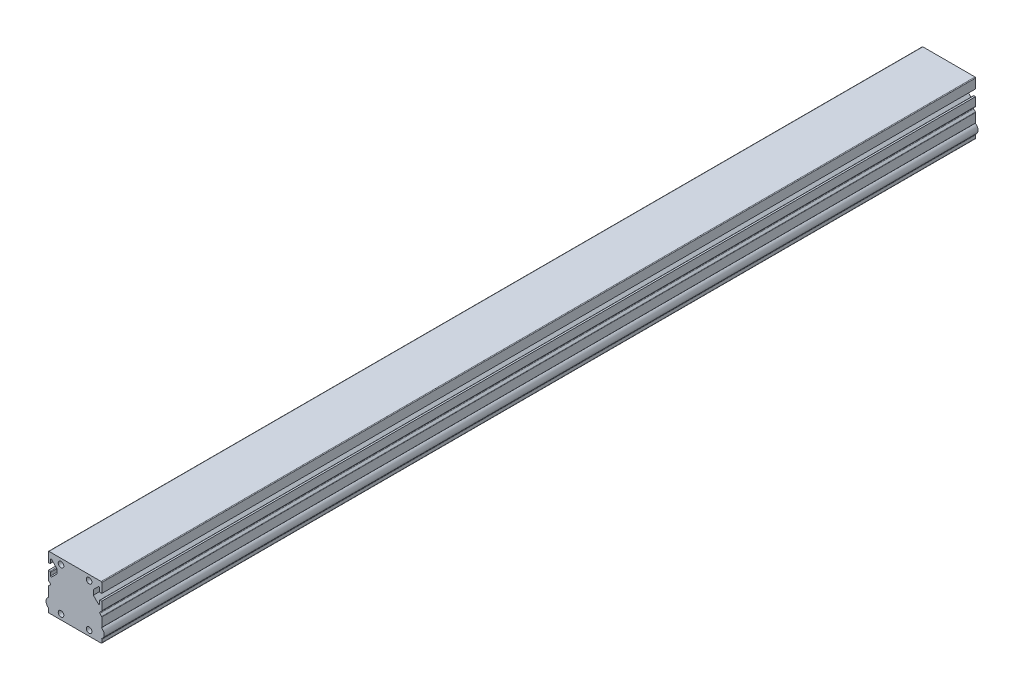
ISO-10303-21;
HEADER;
FILE_DESCRIPTION(('STEP AP214'),'2;1');
FILE_NAME('part.step','',(''),(''),'','','');
FILE_SCHEMA(('AUTOMOTIVE_DESIGN { 1 0 10303 214 1 1 1 1 }'));
ENDSEC;
DATA;
#1=APPLICATION_CONTEXT('core data for automotive mechanical design processes');
#2=APPLICATION_PROTOCOL_DEFINITION('international standard','automotive_design',2000,#1);
#3=PRODUCT_CONTEXT('',#1,'mechanical');
#4=PRODUCT('Part','Part','',(#3));
#5=PRODUCT_RELATED_PRODUCT_CATEGORY('part','',(#4));
#6=PRODUCT_DEFINITION_FORMATION('','',#4);
#7=PRODUCT_DEFINITION_CONTEXT('part definition',#1,'design');
#8=PRODUCT_DEFINITION('design','',#6,#7);
#9=PRODUCT_DEFINITION_SHAPE('','',#8);
#10=(LENGTH_UNIT() NAMED_UNIT(*) SI_UNIT(.MILLI.,.METRE.));
#11=(NAMED_UNIT(*) PLANE_ANGLE_UNIT() SI_UNIT($,.RADIAN.));
#12=(NAMED_UNIT(*) SI_UNIT($,.STERADIAN.) SOLID_ANGLE_UNIT());
#13=UNCERTAINTY_MEASURE_WITH_UNIT(LENGTH_MEASURE(1.E-05),#10,'distance_accuracy_value','');
#14=(GEOMETRIC_REPRESENTATION_CONTEXT(3) GLOBAL_UNCERTAINTY_ASSIGNED_CONTEXT((#13)) GLOBAL_UNIT_ASSIGNED_CONTEXT((#10,
#11,#12)) REPRESENTATION_CONTEXT('',''));
#15=CARTESIAN_POINT('',(0.,0.,0.));
#16=DIRECTION('',(0.,0.,1.));
#17=DIRECTION('',(1.,0.,0.));
#18=AXIS2_PLACEMENT_3D('',#15,#16,#17);
#19=CARTESIAN_POINT('',(-20.,20.,654.));
#20=DIRECTION('',(0.,0.,1.));
#21=DIRECTION('',(1.,0.,0.));
#22=AXIS2_PLACEMENT_3D('',#19,#20,#21);
#23=PLANE('',#22);
#24=CARTESIAN_POINT('',(10.5,16.,654.));
#25=DIRECTION('',(0.,0.,-1.));
#26=DIRECTION('',(-1.,0.,0.));
#27=AXIS2_PLACEMENT_3D('',#24,#25,#26);
#28=CIRCLE('',#27,2.09999999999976);
#29=CARTESIAN_POINT('',(8.40000000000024,16.,654.));
#30=VERTEX_POINT('',#29);
#31=EDGE_CURVE('E406',#30,#30,#28,.T.);
#32=ORIENTED_EDGE('',*,*,#31,.T.);
#33=EDGE_LOOP('',(#32));
#34=FACE_BOUND('',#33,.T.);
#35=CARTESIAN_POINT('',(-10.5,16.,654.));
#36=DIRECTION('',(0.,0.,-1.));
#37=DIRECTION('',(-1.,0.,0.));
#38=AXIS2_PLACEMENT_3D('',#35,#36,#37);
#39=CIRCLE('',#38,2.09999999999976);
#40=CARTESIAN_POINT('',(-12.5999999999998,16.,654.));
#41=VERTEX_POINT('',#40);
#42=EDGE_CURVE('E521',#41,#41,#39,.T.);
#43=ORIENTED_EDGE('',*,*,#42,.T.);
#44=EDGE_LOOP('',(#43));
#45=FACE_BOUND('',#44,.T.);
#46=CARTESIAN_POINT('',(-10.5,-16.,654.));
#47=DIRECTION('',(0.,0.,-1.));
#48=DIRECTION('',(-1.,0.,0.));
#49=AXIS2_PLACEMENT_3D('',#46,#47,#48);
#50=CIRCLE('',#49,2.09999999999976);
#51=CARTESIAN_POINT('',(-12.5999999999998,-16.,654.));
#52=VERTEX_POINT('',#51);
#53=EDGE_CURVE('E515',#52,#52,#50,.T.);
#54=ORIENTED_EDGE('',*,*,#53,.T.);
#55=EDGE_LOOP('',(#54));
#56=FACE_BOUND('',#55,.T.);
#57=DIRECTION('',(-0.707106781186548,-0.707106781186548,0.));
#58=VECTOR('',#57,1.);
#59=CARTESIAN_POINT('',(-20.,-2.64852813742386,654.));
#60=LINE('',#59,#58);
#61=CARTESIAN_POINT('',(-18.5757359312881,-1.22426406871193,654.));
#62=VERTEX_POINT('',#61);
#63=CARTESIAN_POINT('',(-19.8535533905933,-2.50208152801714,654.));
#64=VERTEX_POINT('',#63);
#65=EDGE_CURVE('E531',#62,#64,#60,.T.);
#66=ORIENTED_EDGE('',*,*,#65,.T.);
#67=CARTESIAN_POINT('',(-19.5,-2.85563491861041,654.));
#68=DIRECTION('',(0.,0.,1.));
#69=DIRECTION('',(1.,0.,0.));
#70=AXIS2_PLACEMENT_3D('',#67,#68,#69);
#71=CIRCLE('',#70,0.5);
#72=CARTESIAN_POINT('',(-20.,-2.85563491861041,654.));
#73=VERTEX_POINT('',#72);
#74=EDGE_CURVE('E752',#64,#73,#71,.T.);
#75=ORIENTED_EDGE('',*,*,#74,.T.);
#76=DIRECTION('',(0.,-1.,0.));
#77=VECTOR('',#76,1.);
#78=CARTESIAN_POINT('',(-20.,20.,654.));
#79=LINE('',#78,#77);
#80=CARTESIAN_POINT('',(-20.,-9.53703481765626,654.));
#81=VERTEX_POINT('',#80);
#82=EDGE_CURVE('E641',#73,#81,#79,.T.);
#83=ORIENTED_EDGE('',*,*,#82,.T.);
#84=CARTESIAN_POINT('',(-19.7,-9.53703481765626,654.));
#85=DIRECTION('',(0.,0.,1.));
#86=DIRECTION('',(1.,0.,0.));
#87=AXIS2_PLACEMENT_3D('',#84,#85,#86);
#88=CIRCLE('',#87,0.3);
#89=CARTESIAN_POINT('',(-19.5620689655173,-9.80344620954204,654.));
#90=VERTEX_POINT('',#89);
#91=EDGE_CURVE('E681',#81,#90,#88,.T.);
#92=ORIENTED_EDGE('',*,*,#91,.T.);
#93=CARTESIAN_POINT('',(-17.7,-13.4,654.));
#94=DIRECTION('',(0.,0.,1.));
#95=DIRECTION('',(1.,0.,0.));
#96=AXIS2_PLACEMENT_3D('',#93,#94,#95);
#97=CIRCLE('',#96,4.05);
#98=CARTESIAN_POINT('',(-19.5620689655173,-16.996553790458,654.));
#99=VERTEX_POINT('',#98);
#100=EDGE_CURVE('E381',#99,#90,#97,.F.);
#101=ORIENTED_EDGE('',*,*,#100,.F.);
#102=CARTESIAN_POINT('',(-19.7,-17.2629651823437,654.));
#103=DIRECTION('',(0.,0.,1.));
#104=DIRECTION('',(1.,0.,0.));
#105=AXIS2_PLACEMENT_3D('',#102,#103,#104);
#106=CIRCLE('',#105,0.3);
#107=CARTESIAN_POINT('',(-20.,-17.2629651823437,654.));
#108=VERTEX_POINT('',#107);
#109=EDGE_CURVE('E683',#99,#108,#106,.T.);
#110=ORIENTED_EDGE('',*,*,#109,.T.);
#111=CARTESIAN_POINT('',(-20.,-19.5,654.));
#112=VERTEX_POINT('',#111);
#113=EDGE_CURVE('E668',#108,#112,#79,.T.);
#114=ORIENTED_EDGE('',*,*,#113,.T.);
#115=CARTESIAN_POINT('',(-19.5,-19.5,654.));
#116=DIRECTION('',(0.,0.,1.));
#117=DIRECTION('',(1.,0.,0.));
#118=AXIS2_PLACEMENT_3D('',#115,#116,#117);
#119=CIRCLE('',#118,0.5);
#120=CARTESIAN_POINT('',(-19.5,-20.,654.));
#121=VERTEX_POINT('',#120);
#122=EDGE_CURVE('E715',#112,#121,#119,.T.);
#123=ORIENTED_EDGE('',*,*,#122,.T.);
#124=DIRECTION('',(1.,0.,0.));
#125=VECTOR('',#124,1.);
#126=CARTESIAN_POINT('',(-20.,-20.,654.));
#127=LINE('',#126,#125);
#128=CARTESIAN_POINT('',(19.5,-20.,654.));
#129=VERTEX_POINT('',#128);
#130=EDGE_CURVE('E639',#121,#129,#127,.T.);
#131=ORIENTED_EDGE('',*,*,#130,.T.);
#132=CARTESIAN_POINT('',(19.5,-19.5,654.));
#133=DIRECTION('',(0.,0.,1.));
#134=DIRECTION('',(1.,0.,0.));
#135=AXIS2_PLACEMENT_3D('',#132,#133,#134);
#136=CIRCLE('',#135,0.5);
#137=CARTESIAN_POINT('',(20.,-19.5,654.));
#138=VERTEX_POINT('',#137);
#139=EDGE_CURVE('E717',#129,#138,#136,.T.);
#140=ORIENTED_EDGE('',*,*,#139,.T.);
#141=DIRECTION('',(0.,1.,0.));
#142=VECTOR('',#141,1.);
#143=CARTESIAN_POINT('',(20.,20.,654.));
#144=LINE('',#143,#142);
#145=CARTESIAN_POINT('',(20.,-17.2629651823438,654.));
#146=VERTEX_POINT('',#145);
#147=EDGE_CURVE('E645',#138,#146,#144,.T.);
#148=ORIENTED_EDGE('',*,*,#147,.T.);
#149=CARTESIAN_POINT('',(19.7,-17.2629651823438,654.));
#150=DIRECTION('',(0.,0.,1.));
#151=DIRECTION('',(1.,0.,0.));
#152=AXIS2_PLACEMENT_3D('',#149,#150,#151);
#153=CIRCLE('',#152,0.3);
#154=CARTESIAN_POINT('',(19.5620689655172,-16.996553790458,654.));
#155=VERTEX_POINT('',#154);
#156=EDGE_CURVE('E679',#146,#155,#153,.T.);
#157=ORIENTED_EDGE('',*,*,#156,.T.);
#158=CARTESIAN_POINT('',(17.7,-13.4,654.));
#159=DIRECTION('',(0.,0.,1.));
#160=DIRECTION('',(1.,0.,0.));
#161=AXIS2_PLACEMENT_3D('',#158,#159,#160);
#162=CIRCLE('',#161,4.05);
#163=CARTESIAN_POINT('',(19.5620689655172,-9.80344620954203,654.));
#164=VERTEX_POINT('',#163);
#165=EDGE_CURVE('E394',#164,#155,#162,.F.);
#166=ORIENTED_EDGE('',*,*,#165,.F.);
#167=CARTESIAN_POINT('',(19.7,-9.53703481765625,654.));
#168=DIRECTION('',(0.,0.,1.));
#169=DIRECTION('',(1.,0.,0.));
#170=AXIS2_PLACEMENT_3D('',#167,#168,#169);
#171=CIRCLE('',#170,0.3);
#172=CARTESIAN_POINT('',(20.,-9.53703481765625,654.));
#173=VERTEX_POINT('',#172);
#174=EDGE_CURVE('E677',#164,#173,#171,.T.);
#175=ORIENTED_EDGE('',*,*,#174,.T.);
#176=CARTESIAN_POINT('',(20.,-2.85563491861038,654.));
#177=VERTEX_POINT('',#176);
#178=EDGE_CURVE('E648',#173,#177,#144,.T.);
#179=ORIENTED_EDGE('',*,*,#178,.T.);
#180=CARTESIAN_POINT('',(19.5,-2.85563491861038,654.));
#181=DIRECTION('',(0.,0.,1.));
#182=DIRECTION('',(1.,0.,0.));
#183=AXIS2_PLACEMENT_3D('',#180,#181,#182);
#184=CIRCLE('',#183,0.5);
#185=CARTESIAN_POINT('',(19.8535533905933,-2.50208152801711,654.));
#186=VERTEX_POINT('',#185);
#187=EDGE_CURVE('E748',#177,#186,#184,.T.);
#188=ORIENTED_EDGE('',*,*,#187,.T.);
#189=DIRECTION('',(0.707106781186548,-0.707106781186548,0.));
#190=VECTOR('',#189,1.);
#191=CARTESIAN_POINT('',(20.,-2.64852813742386,654.));
#192=LINE('',#191,#190);
#193=CARTESIAN_POINT('',(18.5757359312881,-1.22426406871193,654.));
#194=VERTEX_POINT('',#193);
#195=EDGE_CURVE('E410',#194,#186,#192,.T.);
#196=ORIENTED_EDGE('',*,*,#195,.F.);
#197=CARTESIAN_POINT('',(19.,-0.800000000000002,654.));
#198=DIRECTION('',(0.,0.,1.));
#199=DIRECTION('',(1.,0.,0.));
#200=AXIS2_PLACEMENT_3D('',#197,#198,#199);
#201=CIRCLE('',#200,0.600000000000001);
#202=CARTESIAN_POINT('',(18.5757359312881,-0.375735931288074,654.));
#203=VERTEX_POINT('',#202);
#204=EDGE_CURVE('E413',#203,#194,#201,.T.);
#205=ORIENTED_EDGE('',*,*,#204,.F.);
#206=DIRECTION('',(-0.707106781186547,-0.707106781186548,0.));
#207=VECTOR('',#206,1.);
#208=CARTESIAN_POINT('',(18.5757359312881,-0.375735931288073,654.));
#209=LINE('',#208,#207);
#210=CARTESIAN_POINT('',(19.8535533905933,0.902081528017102,654.));
#211=VERTEX_POINT('',#210);
#212=EDGE_CURVE('E416',#211,#203,#209,.T.);
#213=ORIENTED_EDGE('',*,*,#212,.F.);
#214=CARTESIAN_POINT('',(19.5,1.25563491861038,654.));
#215=DIRECTION('',(0.,0.,1.));
#216=DIRECTION('',(1.,0.,0.));
#217=AXIS2_PLACEMENT_3D('',#214,#215,#216);
#218=CIRCLE('',#217,0.5);
#219=CARTESIAN_POINT('',(20.,1.25563491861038,654.));
#220=VERTEX_POINT('',#219);
#221=EDGE_CURVE('E47',#211,#220,#218,.T.);
#222=ORIENTED_EDGE('',*,*,#221,.T.);
#223=CARTESIAN_POINT('',(20.,7.5,654.));
#224=VERTEX_POINT('',#223);
#225=EDGE_CURVE('E649',#220,#224,#144,.T.);
#226=ORIENTED_EDGE('',*,*,#225,.T.);
#227=DIRECTION('',(1.,0.,0.));
#228=VECTOR('',#227,1.);
#229=CARTESIAN_POINT('',(20.,7.5,654.));
#230=LINE('',#229,#228);
#231=CARTESIAN_POINT('',(18.8,7.5,654.));
#232=VERTEX_POINT('',#231);
#233=EDGE_CURVE('E432',#232,#224,#230,.T.);
#234=ORIENTED_EDGE('',*,*,#233,.F.);
#235=CARTESIAN_POINT('',(18.8,7.,654.));
#236=DIRECTION('',(0.,0.,-1.));
#237=DIRECTION('',(1.,0.,0.));
#238=AXIS2_PLACEMENT_3D('',#235,#236,#237);
#239=CIRCLE('',#238,0.5);
#240=CARTESIAN_POINT('',(18.3,7.,654.));
#241=VERTEX_POINT('',#240);
#242=EDGE_CURVE('E436',#241,#232,#239,.T.);
#243=ORIENTED_EDGE('',*,*,#242,.F.);
#244=DIRECTION('',(0.,1.,0.));
#245=VECTOR('',#244,1.);
#246=CARTESIAN_POINT('',(18.3,7.,654.));
#247=LINE('',#246,#245);
#248=CARTESIAN_POINT('',(18.3,4.75,654.));
#249=VERTEX_POINT('',#248);
#250=EDGE_CURVE('E438',#249,#241,#247,.T.);
#251=ORIENTED_EDGE('',*,*,#250,.F.);
#252=CARTESIAN_POINT('',(17.8,4.75,654.));
#253=DIRECTION('',(0.,0.,1.));
#254=DIRECTION('',(1.,0.,0.));
#255=AXIS2_PLACEMENT_3D('',#252,#253,#254);
#256=CIRCLE('',#255,0.500000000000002);
#257=CARTESIAN_POINT('',(17.4464466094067,4.39644660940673,654.));
#258=VERTEX_POINT('',#257);
#259=EDGE_CURVE('E440',#258,#249,#256,.T.);
#260=ORIENTED_EDGE('',*,*,#259,.F.);
#261=DIRECTION('',(0.707106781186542,-0.707106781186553,0.));
#262=VECTOR('',#261,1.);
#263=CARTESIAN_POINT('',(17.4464466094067,4.39644660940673,654.));
#264=LINE('',#263,#262);
#265=CARTESIAN_POINT('',(13.7,8.1428932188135,654.));
#266=VERTEX_POINT('',#265);
#267=EDGE_CURVE('E442',#266,#258,#264,.T.);
#268=ORIENTED_EDGE('',*,*,#267,.F.);
#269=DIRECTION('',(0.,-1.,0.));
#270=VECTOR('',#269,1.);
#271=CARTESIAN_POINT('',(13.7,11.8571067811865,654.));
#272=LINE('',#271,#270);
#273=CARTESIAN_POINT('',(13.7,11.8571067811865,654.));
#274=VERTEX_POINT('',#273);
#275=EDGE_CURVE('E444',#274,#266,#272,.T.);
#276=ORIENTED_EDGE('',*,*,#275,.F.);
#277=DIRECTION('',(-0.707106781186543,-0.707106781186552,0.));
#278=VECTOR('',#277,1.);
#279=CARTESIAN_POINT('',(17.4464466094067,15.6035533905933,654.));
#280=LINE('',#279,#278);
#281=CARTESIAN_POINT('',(17.4464466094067,15.6035533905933,654.));
#282=VERTEX_POINT('',#281);
#283=EDGE_CURVE('E446',#282,#274,#280,.T.);
#284=ORIENTED_EDGE('',*,*,#283,.F.);
#285=CARTESIAN_POINT('',(17.8,15.25,654.));
#286=DIRECTION('',(0.,0.,1.));
#287=DIRECTION('',(-1.,0.,0.));
#288=AXIS2_PLACEMENT_3D('',#285,#286,#287);
#289=CIRCLE('',#288,0.5);
#290=CARTESIAN_POINT('',(18.3,15.25,654.));
#291=VERTEX_POINT('',#290);
#292=EDGE_CURVE('E448',#291,#282,#289,.T.);
#293=ORIENTED_EDGE('',*,*,#292,.F.);
#294=DIRECTION('',(0.,1.,0.));
#295=VECTOR('',#294,1.);
#296=CARTESIAN_POINT('',(18.3,13.,654.));
#297=LINE('',#296,#295);
#298=CARTESIAN_POINT('',(18.3,13.,654.));
#299=VERTEX_POINT('',#298);
#300=EDGE_CURVE('E450',#299,#291,#297,.T.);
#301=ORIENTED_EDGE('',*,*,#300,.F.);
#302=CARTESIAN_POINT('',(18.8,13.,654.));
#303=DIRECTION('',(0.,0.,-1.));
#304=DIRECTION('',(-1.,0.,0.));
#305=AXIS2_PLACEMENT_3D('',#302,#303,#304);
#306=CIRCLE('',#305,0.5);
#307=CARTESIAN_POINT('',(18.8,12.5,654.));
#308=VERTEX_POINT('',#307);
#309=EDGE_CURVE('E452',#308,#299,#306,.T.);
#310=ORIENTED_EDGE('',*,*,#309,.F.);
#311=DIRECTION('',(-1.,0.,0.));
#312=VECTOR('',#311,1.);
#313=CARTESIAN_POINT('',(20.,12.5,654.));
#314=LINE('',#313,#312);
#315=CARTESIAN_POINT('',(20.,12.5,654.));
#316=VERTEX_POINT('',#315);
#317=EDGE_CURVE('E430',#316,#308,#314,.T.);
#318=ORIENTED_EDGE('',*,*,#317,.F.);
#319=CARTESIAN_POINT('',(20.,19.5,654.));
#320=VERTEX_POINT('',#319);
#321=EDGE_CURVE('E644',#316,#320,#144,.T.);
#322=ORIENTED_EDGE('',*,*,#321,.T.);
#323=CARTESIAN_POINT('',(19.5,19.5,654.));
#324=DIRECTION('',(0.,0.,1.));
#325=DIRECTION('',(1.,0.,0.));
#326=AXIS2_PLACEMENT_3D('',#323,#324,#325);
#327=CIRCLE('',#326,0.5);
#328=CARTESIAN_POINT('',(19.5,20.,654.));
#329=VERTEX_POINT('',#328);
#330=EDGE_CURVE('E719',#320,#329,#327,.T.);
#331=ORIENTED_EDGE('',*,*,#330,.T.);
#332=DIRECTION('',(-1.,0.,0.));
#333=VECTOR('',#332,1.);
#334=CARTESIAN_POINT('',(-20.,20.,654.));
#335=LINE('',#334,#333);
#336=CARTESIAN_POINT('',(-19.5,20.,654.));
#337=VERTEX_POINT('',#336);
#338=EDGE_CURVE('E647',#329,#337,#335,.T.);
#339=ORIENTED_EDGE('',*,*,#338,.T.);
#340=CARTESIAN_POINT('',(-19.5,19.5,654.));
#341=DIRECTION('',(0.,0.,1.));
#342=DIRECTION('',(1.,0.,0.));
#343=AXIS2_PLACEMENT_3D('',#340,#341,#342);
#344=CIRCLE('',#343,0.5);
#345=CARTESIAN_POINT('',(-20.,19.5,654.));
#346=VERTEX_POINT('',#345);
#347=EDGE_CURVE('E713',#337,#346,#344,.T.);
#348=ORIENTED_EDGE('',*,*,#347,.T.);
#349=CARTESIAN_POINT('',(-20.,12.5,654.));
#350=VERTEX_POINT('',#349);
#351=EDGE_CURVE('E637',#346,#350,#79,.T.);
#352=ORIENTED_EDGE('',*,*,#351,.T.);
#353=DIRECTION('',(1.,0.,0.));
#354=VECTOR('',#353,1.);
#355=CARTESIAN_POINT('',(-20.,12.5,654.));
#356=LINE('',#355,#354);
#357=CARTESIAN_POINT('',(-18.8,12.5,654.));
#358=VERTEX_POINT('',#357);
#359=EDGE_CURVE('E546',#350,#358,#356,.T.);
#360=ORIENTED_EDGE('',*,*,#359,.T.);
#361=CARTESIAN_POINT('',(-18.8,13.,654.));
#362=DIRECTION('',(0.,0.,1.));
#363=DIRECTION('',(1.,0.,0.));
#364=AXIS2_PLACEMENT_3D('',#361,#362,#363);
#365=CIRCLE('',#364,0.5);
#366=CARTESIAN_POINT('',(-18.3,13.,654.));
#367=VERTEX_POINT('',#366);
#368=EDGE_CURVE('E549',#358,#367,#365,.T.);
#369=ORIENTED_EDGE('',*,*,#368,.T.);
#370=DIRECTION('',(0.,1.,0.));
#371=VECTOR('',#370,1.);
#372=CARTESIAN_POINT('',(-18.3,13.,654.));
#373=LINE('',#372,#371);
#374=CARTESIAN_POINT('',(-18.3,15.25,654.));
#375=VERTEX_POINT('',#374);
#376=EDGE_CURVE('E553',#367,#375,#373,.T.);
#377=ORIENTED_EDGE('',*,*,#376,.T.);
#378=CARTESIAN_POINT('',(-17.8,15.25,654.));
#379=DIRECTION('',(0.,0.,-1.));
#380=DIRECTION('',(1.,0.,0.));
#381=AXIS2_PLACEMENT_3D('',#378,#379,#380);
#382=CIRCLE('',#381,0.5);
#383=CARTESIAN_POINT('',(-17.4464466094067,15.6035533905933,654.));
#384=VERTEX_POINT('',#383);
#385=EDGE_CURVE('E556',#375,#384,#382,.T.);
#386=ORIENTED_EDGE('',*,*,#385,.T.);
#387=DIRECTION('',(0.707106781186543,-0.707106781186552,0.));
#388=VECTOR('',#387,1.);
#389=CARTESIAN_POINT('',(-17.4464466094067,15.6035533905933,654.));
#390=LINE('',#389,#388);
#391=CARTESIAN_POINT('',(-13.7,11.8571067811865,654.));
#392=VERTEX_POINT('',#391);
#393=EDGE_CURVE('E559',#384,#392,#390,.T.);
#394=ORIENTED_EDGE('',*,*,#393,.T.);
#395=DIRECTION('',(0.,-1.,0.));
#396=VECTOR('',#395,1.);
#397=CARTESIAN_POINT('',(-13.7,11.8571067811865,654.));
#398=LINE('',#397,#396);
#399=CARTESIAN_POINT('',(-13.7,8.1428932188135,654.));
#400=VERTEX_POINT('',#399);
#401=EDGE_CURVE('E562',#392,#400,#398,.T.);
#402=ORIENTED_EDGE('',*,*,#401,.T.);
#403=DIRECTION('',(-0.707106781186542,-0.707106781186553,0.));
#404=VECTOR('',#403,1.);
#405=CARTESIAN_POINT('',(-17.4464466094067,4.39644660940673,654.));
#406=LINE('',#405,#404);
#407=CARTESIAN_POINT('',(-17.4464466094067,4.39644660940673,654.));
#408=VERTEX_POINT('',#407);
#409=EDGE_CURVE('E565',#400,#408,#406,.T.);
#410=ORIENTED_EDGE('',*,*,#409,.T.);
#411=CARTESIAN_POINT('',(-17.8,4.75,654.));
#412=DIRECTION('',(0.,0.,-1.));
#413=DIRECTION('',(-1.,0.,0.));
#414=AXIS2_PLACEMENT_3D('',#411,#412,#413);
#415=CIRCLE('',#414,0.500000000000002);
#416=CARTESIAN_POINT('',(-18.3,4.75,654.));
#417=VERTEX_POINT('',#416);
#418=EDGE_CURVE('E568',#408,#417,#415,.T.);
#419=ORIENTED_EDGE('',*,*,#418,.T.);
#420=DIRECTION('',(0.,1.,0.));
#421=VECTOR('',#420,1.);
#422=CARTESIAN_POINT('',(-18.3,7.,654.));
#423=LINE('',#422,#421);
#424=CARTESIAN_POINT('',(-18.3,7.,654.));
#425=VERTEX_POINT('',#424);
#426=EDGE_CURVE('E571',#417,#425,#423,.T.);
#427=ORIENTED_EDGE('',*,*,#426,.T.);
#428=CARTESIAN_POINT('',(-18.8,7.,654.));
#429=DIRECTION('',(0.,0.,1.));
#430=DIRECTION('',(-1.,0.,0.));
#431=AXIS2_PLACEMENT_3D('',#428,#429,#430);
#432=CIRCLE('',#431,0.5);
#433=CARTESIAN_POINT('',(-18.8,7.5,654.));
#434=VERTEX_POINT('',#433);
#435=EDGE_CURVE('E574',#425,#434,#432,.T.);
#436=ORIENTED_EDGE('',*,*,#435,.T.);
#437=DIRECTION('',(-1.,0.,0.));
#438=VECTOR('',#437,1.);
#439=CARTESIAN_POINT('',(-20.,7.5,654.));
#440=LINE('',#439,#438);
#441=CARTESIAN_POINT('',(-20.,7.5,654.));
#442=VERTEX_POINT('',#441);
#443=EDGE_CURVE('E577',#434,#442,#440,.T.);
#444=ORIENTED_EDGE('',*,*,#443,.T.);
#445=CARTESIAN_POINT('',(-20.,1.2556349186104,654.));
#446=VERTEX_POINT('',#445);
#447=EDGE_CURVE('E640',#442,#446,#79,.T.);
#448=ORIENTED_EDGE('',*,*,#447,.T.);
#449=CARTESIAN_POINT('',(-19.5,1.2556349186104,654.));
#450=DIRECTION('',(0.,0.,1.));
#451=DIRECTION('',(1.,0.,0.));
#452=AXIS2_PLACEMENT_3D('',#449,#450,#451);
#453=CIRCLE('',#452,0.5);
#454=CARTESIAN_POINT('',(-19.8535533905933,0.90208152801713,654.));
#455=VERTEX_POINT('',#454);
#456=EDGE_CURVE('E750',#446,#455,#453,.T.);
#457=ORIENTED_EDGE('',*,*,#456,.T.);
#458=DIRECTION('',(0.707106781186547,-0.707106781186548,0.));
#459=VECTOR('',#458,1.);
#460=CARTESIAN_POINT('',(-18.5757359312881,-0.375735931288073,654.));
#461=LINE('',#460,#459);
#462=CARTESIAN_POINT('',(-18.5757359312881,-0.375735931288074,654.));
#463=VERTEX_POINT('',#462);
#464=EDGE_CURVE('E525',#455,#463,#461,.T.);
#465=ORIENTED_EDGE('',*,*,#464,.T.);
#466=CARTESIAN_POINT('',(-19.,-0.800000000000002,654.));
#467=DIRECTION('',(0.,0.,-1.));
#468=DIRECTION('',(-1.,0.,0.));
#469=AXIS2_PLACEMENT_3D('',#466,#467,#468);
#470=CIRCLE('',#469,0.600000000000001);
#471=EDGE_CURVE('E527',#463,#62,#470,.T.);
#472=ORIENTED_EDGE('',*,*,#471,.T.);
#473=EDGE_LOOP('',(#66,#75,#83,#92,#101,#110,#114,#123,#131,#140,#148,#157,#166,#175,#179,#188,
#196,#205,#213,#222,#226,#234,#243,#251,#260,#268,#276,#284,#293,#301,#310,#318,#322,#331,#339,
#348,#352,#360,#369,#377,#386,#394,#402,#410,#419,#427,#436,#444,#448,#457,#465,#472));
#474=FACE_BOUND('',#473,.T.);
#475=CARTESIAN_POINT('',(10.5,-16.,654.));
#476=DIRECTION('',(0.,0.,-1.));
#477=DIRECTION('',(-1.,0.,0.));
#478=AXIS2_PLACEMENT_3D('',#475,#476,#477);
#479=CIRCLE('',#478,2.09999999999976);
#480=CARTESIAN_POINT('',(8.40000000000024,-16.,654.));
#481=VERTEX_POINT('',#480);
#482=EDGE_CURVE('E400',#481,#481,#479,.T.);
#483=ORIENTED_EDGE('',*,*,#482,.T.);
#484=EDGE_LOOP('',(#483));
#485=FACE_BOUND('',#484,.T.);
#486=ADVANCED_FACE('F32',(#34,#45,#56,#474,#485),#23,.T.);
#487=CARTESIAN_POINT('',(-20.,20.,0.));
#488=DIRECTION('',(0.,0.,1.));
#489=DIRECTION('',(1.,0.,0.));
#490=AXIS2_PLACEMENT_3D('',#487,#488,#489);
#491=PLANE('',#490);
#492=CARTESIAN_POINT('',(10.5,16.,0.));
#493=DIRECTION('',(0.,0.,-1.));
#494=DIRECTION('',(-1.,0.,0.));
#495=AXIS2_PLACEMENT_3D('',#492,#493,#494);
#496=CIRCLE('',#495,2.09999999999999);
#497=CARTESIAN_POINT('',(8.40000000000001,16.,0.));
#498=VERTEX_POINT('',#497);
#499=EDGE_CURVE('E403',#498,#498,#496,.T.);
#500=ORIENTED_EDGE('',*,*,#499,.F.);
#501=EDGE_LOOP('',(#500));
#502=FACE_BOUND('',#501,.T.);
#503=CARTESIAN_POINT('',(-10.5,16.,0.));
#504=DIRECTION('',(0.,0.,-1.));
#505=DIRECTION('',(-1.,0.,0.));
#506=AXIS2_PLACEMENT_3D('',#503,#504,#505);
#507=CIRCLE('',#506,2.09999999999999);
#508=CARTESIAN_POINT('',(-12.6,16.,0.));
#509=VERTEX_POINT('',#508);
#510=EDGE_CURVE('E518',#509,#509,#507,.T.);
#511=ORIENTED_EDGE('',*,*,#510,.F.);
#512=EDGE_LOOP('',(#511));
#513=FACE_BOUND('',#512,.T.);
#514=CARTESIAN_POINT('',(-10.5,-16.,0.));
#515=DIRECTION('',(0.,0.,-1.));
#516=DIRECTION('',(-1.,0.,0.));
#517=AXIS2_PLACEMENT_3D('',#514,#515,#516);
#518=CIRCLE('',#517,2.09999999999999);
#519=CARTESIAN_POINT('',(-12.6,-16.,0.));
#520=VERTEX_POINT('',#519);
#521=EDGE_CURVE('E489',#520,#520,#518,.T.);
#522=ORIENTED_EDGE('',*,*,#521,.F.);
#523=EDGE_LOOP('',(#522));
#524=FACE_BOUND('',#523,.T.);
#525=DIRECTION('',(0.,-1.,0.));
#526=VECTOR('',#525,1.);
#527=CARTESIAN_POINT('',(-20.,20.,0.));
#528=LINE('',#527,#526);
#529=CARTESIAN_POINT('',(-20.,-2.85563491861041,0.));
#530=VERTEX_POINT('',#529);
#531=CARTESIAN_POINT('',(-20.,-9.53703481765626,0.));
#532=VERTEX_POINT('',#531);
#533=EDGE_CURVE('E657',#530,#532,#528,.T.);
#534=ORIENTED_EDGE('',*,*,#533,.F.);
#535=CARTESIAN_POINT('',(-19.5,-2.85563491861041,0.));
#536=DIRECTION('',(0.,0.,1.));
#537=DIRECTION('',(1.,0.,0.));
#538=AXIS2_PLACEMENT_3D('',#535,#536,#537);
#539=CIRCLE('',#538,0.5);
#540=CARTESIAN_POINT('',(-19.8535533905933,-2.50208152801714,0.));
#541=VERTEX_POINT('',#540);
#542=EDGE_CURVE('E743',#530,#541,#539,.F.);
#543=ORIENTED_EDGE('',*,*,#542,.T.);
#544=DIRECTION('',(-0.707106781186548,-0.707106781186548,0.));
#545=VECTOR('',#544,1.);
#546=CARTESIAN_POINT('',(-20.,-2.64852813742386,0.));
#547=LINE('',#546,#545);
#548=CARTESIAN_POINT('',(-18.5757359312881,-1.22426406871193,0.));
#549=VERTEX_POINT('',#548);
#550=EDGE_CURVE('E528',#549,#541,#547,.T.);
#551=ORIENTED_EDGE('',*,*,#550,.F.);
#552=CARTESIAN_POINT('',(-19.,-0.800000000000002,0.));
#553=DIRECTION('',(0.,0.,-1.));
#554=DIRECTION('',(-1.,0.,0.));
#555=AXIS2_PLACEMENT_3D('',#552,#553,#554);
#556=CIRCLE('',#555,0.600000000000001);
#557=CARTESIAN_POINT('',(-18.5757359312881,-0.375735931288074,0.));
#558=VERTEX_POINT('',#557);
#559=EDGE_CURVE('E536',#558,#549,#556,.T.);
#560=ORIENTED_EDGE('',*,*,#559,.F.);
#561=DIRECTION('',(0.707106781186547,-0.707106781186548,0.));
#562=VECTOR('',#561,1.);
#563=CARTESIAN_POINT('',(-18.5757359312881,-0.375735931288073,0.));
#564=LINE('',#563,#562);
#565=CARTESIAN_POINT('',(-19.8535533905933,0.90208152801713,0.));
#566=VERTEX_POINT('',#565);
#567=EDGE_CURVE('E524',#566,#558,#564,.T.);
#568=ORIENTED_EDGE('',*,*,#567,.F.);
#569=CARTESIAN_POINT('',(-19.5,1.2556349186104,0.));
#570=DIRECTION('',(0.,0.,1.));
#571=DIRECTION('',(1.,0.,0.));
#572=AXIS2_PLACEMENT_3D('',#569,#570,#571);
#573=CIRCLE('',#572,0.5);
#574=CARTESIAN_POINT('',(-20.,1.2556349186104,0.));
#575=VERTEX_POINT('',#574);
#576=EDGE_CURVE('E741',#566,#575,#573,.F.);
#577=ORIENTED_EDGE('',*,*,#576,.T.);
#578=CARTESIAN_POINT('',(-20.,7.5,0.));
#579=VERTEX_POINT('',#578);
#580=EDGE_CURVE('E656',#579,#575,#528,.T.);
#581=ORIENTED_EDGE('',*,*,#580,.F.);
#582=DIRECTION('',(-1.,0.,0.));
#583=VECTOR('',#582,1.);
#584=CARTESIAN_POINT('',(-20.,7.5,0.));
#585=LINE('',#584,#583);
#586=CARTESIAN_POINT('',(-18.8,7.5,0.));
#587=VERTEX_POINT('',#586);
#588=EDGE_CURVE('E550',#587,#579,#585,.T.);
#589=ORIENTED_EDGE('',*,*,#588,.F.);
#590=CARTESIAN_POINT('',(-18.8,7.,0.));
#591=DIRECTION('',(0.,0.,1.));
#592=DIRECTION('',(-1.,0.,0.));
#593=AXIS2_PLACEMENT_3D('',#590,#591,#592);
#594=CIRCLE('',#593,0.5);
#595=CARTESIAN_POINT('',(-18.3,7.,0.));
#596=VERTEX_POINT('',#595);
#597=EDGE_CURVE('E606',#596,#587,#594,.T.);
#598=ORIENTED_EDGE('',*,*,#597,.F.);
#599=DIRECTION('',(0.,1.,0.));
#600=VECTOR('',#599,1.);
#601=CARTESIAN_POINT('',(-18.3,7.,0.));
#602=LINE('',#601,#600);
#603=CARTESIAN_POINT('',(-18.3,4.75,0.));
#604=VERTEX_POINT('',#603);
#605=EDGE_CURVE('E603',#604,#596,#602,.T.);
#606=ORIENTED_EDGE('',*,*,#605,.F.);
#607=CARTESIAN_POINT('',(-17.8,4.75,0.));
#608=DIRECTION('',(0.,0.,-1.));
#609=DIRECTION('',(-1.,0.,0.));
#610=AXIS2_PLACEMENT_3D('',#607,#608,#609);
#611=CIRCLE('',#610,0.500000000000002);
#612=CARTESIAN_POINT('',(-17.4464466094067,4.39644660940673,0.));
#613=VERTEX_POINT('',#612);
#614=EDGE_CURVE('E600',#613,#604,#611,.T.);
#615=ORIENTED_EDGE('',*,*,#614,.F.);
#616=DIRECTION('',(-0.707106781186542,-0.707106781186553,0.));
#617=VECTOR('',#616,1.);
#618=CARTESIAN_POINT('',(-17.4464466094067,4.39644660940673,0.));
#619=LINE('',#618,#617);
#620=CARTESIAN_POINT('',(-13.7,8.1428932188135,0.));
#621=VERTEX_POINT('',#620);
#622=EDGE_CURVE('E597',#621,#613,#619,.T.);
#623=ORIENTED_EDGE('',*,*,#622,.F.);
#624=DIRECTION('',(0.,-1.,0.));
#625=VECTOR('',#624,1.);
#626=CARTESIAN_POINT('',(-13.7,11.8571067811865,0.));
#627=LINE('',#626,#625);
#628=CARTESIAN_POINT('',(-13.7,11.8571067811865,0.));
#629=VERTEX_POINT('',#628);
#630=EDGE_CURVE('E594',#629,#621,#627,.T.);
#631=ORIENTED_EDGE('',*,*,#630,.F.);
#632=DIRECTION('',(0.707106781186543,-0.707106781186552,0.));
#633=VECTOR('',#632,1.);
#634=CARTESIAN_POINT('',(-17.4464466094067,15.6035533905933,0.));
#635=LINE('',#634,#633);
#636=CARTESIAN_POINT('',(-17.4464466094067,15.6035533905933,0.));
#637=VERTEX_POINT('',#636);
#638=EDGE_CURVE('E591',#637,#629,#635,.T.);
#639=ORIENTED_EDGE('',*,*,#638,.F.);
#640=CARTESIAN_POINT('',(-17.8,15.25,0.));
#641=DIRECTION('',(0.,0.,-1.));
#642=DIRECTION('',(1.,0.,0.));
#643=AXIS2_PLACEMENT_3D('',#640,#641,#642);
#644=CIRCLE('',#643,0.5);
#645=CARTESIAN_POINT('',(-18.3,15.25,0.));
#646=VERTEX_POINT('',#645);
#647=EDGE_CURVE('E588',#646,#637,#644,.T.);
#648=ORIENTED_EDGE('',*,*,#647,.F.);
#649=DIRECTION('',(0.,1.,0.));
#650=VECTOR('',#649,1.);
#651=CARTESIAN_POINT('',(-18.3,13.,0.));
#652=LINE('',#651,#650);
#653=CARTESIAN_POINT('',(-18.3,13.,0.));
#654=VERTEX_POINT('',#653);
#655=EDGE_CURVE('E585',#654,#646,#652,.T.);
#656=ORIENTED_EDGE('',*,*,#655,.F.);
#657=CARTESIAN_POINT('',(-18.8,13.,0.));
#658=DIRECTION('',(0.,0.,1.));
#659=DIRECTION('',(1.,0.,0.));
#660=AXIS2_PLACEMENT_3D('',#657,#658,#659);
#661=CIRCLE('',#660,0.5);
#662=CARTESIAN_POINT('',(-18.8,12.5,0.));
#663=VERTEX_POINT('',#662);
#664=EDGE_CURVE('E582',#663,#654,#661,.T.);
#665=ORIENTED_EDGE('',*,*,#664,.F.);
#666=DIRECTION('',(1.,0.,0.));
#667=VECTOR('',#666,1.);
#668=CARTESIAN_POINT('',(-20.,12.5,0.));
#669=LINE('',#668,#667);
#670=CARTESIAN_POINT('',(-20.,12.5,0.));
#671=VERTEX_POINT('',#670);
#672=EDGE_CURVE('E543',#671,#663,#669,.T.);
#673=ORIENTED_EDGE('',*,*,#672,.F.);
#674=CARTESIAN_POINT('',(-20.,19.5,0.));
#675=VERTEX_POINT('',#674);
#676=EDGE_CURVE('E653',#675,#671,#528,.T.);
#677=ORIENTED_EDGE('',*,*,#676,.F.);
#678=CARTESIAN_POINT('',(-19.5,19.5,0.));
#679=DIRECTION('',(0.,0.,1.));
#680=DIRECTION('',(1.,0.,0.));
#681=AXIS2_PLACEMENT_3D('',#678,#679,#680);
#682=CIRCLE('',#681,0.5);
#683=CARTESIAN_POINT('',(-19.5,20.,0.));
#684=VERTEX_POINT('',#683);
#685=EDGE_CURVE('E703',#675,#684,#682,.F.);
#686=ORIENTED_EDGE('',*,*,#685,.T.);
#687=DIRECTION('',(-1.,0.,0.));
#688=VECTOR('',#687,1.);
#689=CARTESIAN_POINT('',(-20.,20.,0.));
#690=LINE('',#689,#688);
#691=CARTESIAN_POINT('',(19.5,20.,0.));
#692=VERTEX_POINT('',#691);
#693=EDGE_CURVE('E663',#692,#684,#690,.T.);
#694=ORIENTED_EDGE('',*,*,#693,.F.);
#695=CARTESIAN_POINT('',(19.5,19.5,0.));
#696=DIRECTION('',(0.,0.,1.));
#697=DIRECTION('',(1.,0.,0.));
#698=AXIS2_PLACEMENT_3D('',#695,#696,#697);
#699=CIRCLE('',#698,0.5);
#700=CARTESIAN_POINT('',(20.,19.5,0.));
#701=VERTEX_POINT('',#700);
#702=EDGE_CURVE('E709',#692,#701,#699,.F.);
#703=ORIENTED_EDGE('',*,*,#702,.T.);
#704=DIRECTION('',(0.,1.,0.));
#705=VECTOR('',#704,1.);
#706=CARTESIAN_POINT('',(20.,20.,0.));
#707=LINE('',#706,#705);
#708=CARTESIAN_POINT('',(20.,12.5,0.));
#709=VERTEX_POINT('',#708);
#710=EDGE_CURVE('E660',#709,#701,#707,.T.);
#711=ORIENTED_EDGE('',*,*,#710,.F.);
#712=DIRECTION('',(-1.,0.,0.));
#713=VECTOR('',#712,1.);
#714=CARTESIAN_POINT('',(20.,12.5,0.));
#715=LINE('',#714,#713);
#716=CARTESIAN_POINT('',(18.8,12.5,0.));
#717=VERTEX_POINT('',#716);
#718=EDGE_CURVE('E428',#709,#717,#715,.T.);
#719=ORIENTED_EDGE('',*,*,#718,.T.);
#720=CARTESIAN_POINT('',(18.8,13.,0.));
#721=DIRECTION('',(0.,0.,-1.));
#722=DIRECTION('',(-1.,0.,0.));
#723=AXIS2_PLACEMENT_3D('',#720,#721,#722);
#724=CIRCLE('',#723,0.5);
#725=CARTESIAN_POINT('',(18.3,13.,0.));
#726=VERTEX_POINT('',#725);
#727=EDGE_CURVE('E433',#717,#726,#724,.T.);
#728=ORIENTED_EDGE('',*,*,#727,.T.);
#729=DIRECTION('',(0.,1.,0.));
#730=VECTOR('',#729,1.);
#731=CARTESIAN_POINT('',(18.3,13.,0.));
#732=LINE('',#731,#730);
#733=CARTESIAN_POINT('',(18.3,15.25,0.));
#734=VERTEX_POINT('',#733);
#735=EDGE_CURVE('E481',#726,#734,#732,.T.);
#736=ORIENTED_EDGE('',*,*,#735,.T.);
#737=CARTESIAN_POINT('',(17.8,15.25,0.));
#738=DIRECTION('',(0.,0.,1.));
#739=DIRECTION('',(-1.,0.,0.));
#740=AXIS2_PLACEMENT_3D('',#737,#738,#739);
#741=CIRCLE('',#740,0.5);
#742=CARTESIAN_POINT('',(17.4464466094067,15.6035533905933,0.));
#743=VERTEX_POINT('',#742);
#744=EDGE_CURVE('E478',#734,#743,#741,.T.);
#745=ORIENTED_EDGE('',*,*,#744,.T.);
#746=DIRECTION('',(-0.707106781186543,-0.707106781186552,0.));
#747=VECTOR('',#746,1.);
#748=CARTESIAN_POINT('',(17.4464466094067,15.6035533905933,0.));
#749=LINE('',#748,#747);
#750=CARTESIAN_POINT('',(13.7,11.8571067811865,0.));
#751=VERTEX_POINT('',#750);
#752=EDGE_CURVE('E475',#743,#751,#749,.T.);
#753=ORIENTED_EDGE('',*,*,#752,.T.);
#754=DIRECTION('',(0.,-1.,0.));
#755=VECTOR('',#754,1.);
#756=CARTESIAN_POINT('',(13.7,11.8571067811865,0.));
#757=LINE('',#756,#755);
#758=CARTESIAN_POINT('',(13.7,8.1428932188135,0.));
#759=VERTEX_POINT('',#758);
#760=EDGE_CURVE('E472',#751,#759,#757,.T.);
#761=ORIENTED_EDGE('',*,*,#760,.T.);
#762=DIRECTION('',(0.707106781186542,-0.707106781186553,0.));
#763=VECTOR('',#762,1.);
#764=CARTESIAN_POINT('',(17.4464466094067,4.39644660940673,0.));
#765=LINE('',#764,#763);
#766=CARTESIAN_POINT('',(17.4464466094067,4.39644660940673,0.));
#767=VERTEX_POINT('',#766);
#768=EDGE_CURVE('E469',#759,#767,#765,.T.);
#769=ORIENTED_EDGE('',*,*,#768,.T.);
#770=CARTESIAN_POINT('',(17.8,4.75,0.));
#771=DIRECTION('',(0.,0.,1.));
#772=DIRECTION('',(1.,0.,0.));
#773=AXIS2_PLACEMENT_3D('',#770,#771,#772);
#774=CIRCLE('',#773,0.500000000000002);
#775=CARTESIAN_POINT('',(18.3,4.75,0.));
#776=VERTEX_POINT('',#775);
#777=EDGE_CURVE('E466',#767,#776,#774,.T.);
#778=ORIENTED_EDGE('',*,*,#777,.T.);
#779=DIRECTION('',(0.,1.,0.));
#780=VECTOR('',#779,1.);
#781=CARTESIAN_POINT('',(18.3,7.,0.));
#782=LINE('',#781,#780);
#783=CARTESIAN_POINT('',(18.3,7.,0.));
#784=VERTEX_POINT('',#783);
#785=EDGE_CURVE('E463',#776,#784,#782,.T.);
#786=ORIENTED_EDGE('',*,*,#785,.T.);
#787=CARTESIAN_POINT('',(18.8,7.,0.));
#788=DIRECTION('',(0.,0.,-1.));
#789=DIRECTION('',(1.,0.,0.));
#790=AXIS2_PLACEMENT_3D('',#787,#788,#789);
#791=CIRCLE('',#790,0.5);
#792=CARTESIAN_POINT('',(18.8,7.5,0.));
#793=VERTEX_POINT('',#792);
#794=EDGE_CURVE('E460',#784,#793,#791,.T.);
#795=ORIENTED_EDGE('',*,*,#794,.T.);
#796=DIRECTION('',(1.,0.,0.));
#797=VECTOR('',#796,1.);
#798=CARTESIAN_POINT('',(20.,7.5,0.));
#799=LINE('',#798,#797);
#800=CARTESIAN_POINT('',(20.,7.5,0.));
#801=VERTEX_POINT('',#800);
#802=EDGE_CURVE('E457',#793,#801,#799,.T.);
#803=ORIENTED_EDGE('',*,*,#802,.T.);
#804=CARTESIAN_POINT('',(20.,1.25563491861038,0.));
#805=VERTEX_POINT('',#804);
#806=EDGE_CURVE('E665',#805,#801,#707,.T.);
#807=ORIENTED_EDGE('',*,*,#806,.F.);
#808=CARTESIAN_POINT('',(19.5,1.25563491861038,0.));
#809=DIRECTION('',(0.,0.,1.));
#810=DIRECTION('',(1.,0.,0.));
#811=AXIS2_PLACEMENT_3D('',#808,#809,#810);
#812=CIRCLE('',#811,0.5);
#813=CARTESIAN_POINT('',(19.8535533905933,0.902081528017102,0.));
#814=VERTEX_POINT('',#813);
#815=EDGE_CURVE('E737',#805,#814,#812,.F.);
#816=ORIENTED_EDGE('',*,*,#815,.T.);
#817=DIRECTION('',(-0.707106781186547,-0.707106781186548,0.));
#818=VECTOR('',#817,1.);
#819=CARTESIAN_POINT('',(18.5757359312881,-0.375735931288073,0.));
#820=LINE('',#819,#818);
#821=CARTESIAN_POINT('',(18.5757359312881,-0.375735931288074,0.));
#822=VERTEX_POINT('',#821);
#823=EDGE_CURVE('E414',#814,#822,#820,.T.);
#824=ORIENTED_EDGE('',*,*,#823,.T.);
#825=CARTESIAN_POINT('',(19.,-0.800000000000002,0.));
#826=DIRECTION('',(0.,0.,1.));
#827=DIRECTION('',(1.,0.,0.));
#828=AXIS2_PLACEMENT_3D('',#825,#826,#827);
#829=CIRCLE('',#828,0.600000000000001);
#830=CARTESIAN_POINT('',(18.5757359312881,-1.22426406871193,0.));
#831=VERTEX_POINT('',#830);
#832=EDGE_CURVE('E421',#822,#831,#829,.T.);
#833=ORIENTED_EDGE('',*,*,#832,.T.);
#834=DIRECTION('',(0.707106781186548,-0.707106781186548,0.));
#835=VECTOR('',#834,1.);
#836=CARTESIAN_POINT('',(20.,-2.64852813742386,0.));
#837=LINE('',#836,#835);
#838=CARTESIAN_POINT('',(19.8535533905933,-2.50208152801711,0.));
#839=VERTEX_POINT('',#838);
#840=EDGE_CURVE('E409',#831,#839,#837,.T.);
#841=ORIENTED_EDGE('',*,*,#840,.T.);
#842=CARTESIAN_POINT('',(19.5,-2.85563491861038,0.));
#843=DIRECTION('',(0.,0.,1.));
#844=DIRECTION('',(1.,0.,0.));
#845=AXIS2_PLACEMENT_3D('',#842,#843,#844);
#846=CIRCLE('',#845,0.5);
#847=CARTESIAN_POINT('',(20.,-2.85563491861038,0.));
#848=VERTEX_POINT('',#847);
#849=EDGE_CURVE('E739',#839,#848,#846,.F.);
#850=ORIENTED_EDGE('',*,*,#849,.T.);
#851=CARTESIAN_POINT('',(20.,-9.53703481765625,0.));
#852=VERTEX_POINT('',#851);
#853=EDGE_CURVE('E664',#852,#848,#707,.T.);
#854=ORIENTED_EDGE('',*,*,#853,.F.);
#855=CARTESIAN_POINT('',(19.7,-9.53703481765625,0.));
#856=DIRECTION('',(0.,0.,1.));
#857=DIRECTION('',(1.,0.,0.));
#858=AXIS2_PLACEMENT_3D('',#855,#856,#857);
#859=CIRCLE('',#858,0.3);
#860=CARTESIAN_POINT('',(19.5620689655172,-9.80344620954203,0.));
#861=VERTEX_POINT('',#860);
#862=EDGE_CURVE('E671',#852,#861,#859,.F.);
#863=ORIENTED_EDGE('',*,*,#862,.T.);
#864=CARTESIAN_POINT('',(17.7,-13.4,0.));
#865=DIRECTION('',(0.,0.,-1.));
#866=DIRECTION('',(-1.,0.,0.));
#867=AXIS2_PLACEMENT_3D('',#864,#865,#866);
#868=CIRCLE('',#867,4.05);
#869=CARTESIAN_POINT('',(19.5620689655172,-16.996553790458,0.));
#870=VERTEX_POINT('',#869);
#871=EDGE_CURVE('E389',#861,#870,#868,.T.);
#872=ORIENTED_EDGE('',*,*,#871,.T.);
#873=CARTESIAN_POINT('',(19.7,-17.2629651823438,0.));
#874=DIRECTION('',(0.,0.,1.));
#875=DIRECTION('',(1.,0.,0.));
#876=AXIS2_PLACEMENT_3D('',#873,#874,#875);
#877=CIRCLE('',#876,0.3);
#878=CARTESIAN_POINT('',(20.,-17.2629651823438,0.));
#879=VERTEX_POINT('',#878);
#880=EDGE_CURVE('E373',#870,#879,#877,.F.);
#881=ORIENTED_EDGE('',*,*,#880,.T.);
#882=CARTESIAN_POINT('',(20.,-19.5,0.));
#883=VERTEX_POINT('',#882);
#884=EDGE_CURVE('E661',#883,#879,#707,.T.);
#885=ORIENTED_EDGE('',*,*,#884,.F.);
#886=CARTESIAN_POINT('',(19.5,-19.5,0.));
#887=DIRECTION('',(0.,0.,1.));
#888=DIRECTION('',(1.,0.,0.));
#889=AXIS2_PLACEMENT_3D('',#886,#887,#888);
#890=CIRCLE('',#889,0.5);
#891=CARTESIAN_POINT('',(19.5,-20.,0.));
#892=VERTEX_POINT('',#891);
#893=EDGE_CURVE('E707',#883,#892,#890,.F.);
#894=ORIENTED_EDGE('',*,*,#893,.T.);
#895=DIRECTION('',(1.,0.,0.));
#896=VECTOR('',#895,1.);
#897=CARTESIAN_POINT('',(-20.,-20.,0.));
#898=LINE('',#897,#896);
#899=CARTESIAN_POINT('',(-19.5,-20.,0.));
#900=VERTEX_POINT('',#899);
#901=EDGE_CURVE('E655',#900,#892,#898,.T.);
#902=ORIENTED_EDGE('',*,*,#901,.F.);
#903=CARTESIAN_POINT('',(-19.5,-19.5,0.));
#904=DIRECTION('',(0.,0.,1.));
#905=DIRECTION('',(1.,0.,0.));
#906=AXIS2_PLACEMENT_3D('',#903,#904,#905);
#907=CIRCLE('',#906,0.5);
#908=CARTESIAN_POINT('',(-20.,-19.5,0.));
#909=VERTEX_POINT('',#908);
#910=EDGE_CURVE('E705',#900,#909,#907,.F.);
#911=ORIENTED_EDGE('',*,*,#910,.T.);
#912=CARTESIAN_POINT('',(-20.,-17.2629651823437,0.));
#913=VERTEX_POINT('',#912);
#914=EDGE_CURVE('E613',#913,#909,#528,.T.);
#915=ORIENTED_EDGE('',*,*,#914,.F.);
#916=CARTESIAN_POINT('',(-19.7,-17.2629651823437,0.));
#917=DIRECTION('',(0.,0.,1.));
#918=DIRECTION('',(1.,0.,0.));
#919=AXIS2_PLACEMENT_3D('',#916,#917,#918);
#920=CIRCLE('',#919,0.3);
#921=CARTESIAN_POINT('',(-19.5620689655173,-16.996553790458,0.));
#922=VERTEX_POINT('',#921);
#923=EDGE_CURVE('E372',#913,#922,#920,.F.);
#924=ORIENTED_EDGE('',*,*,#923,.T.);
#925=CARTESIAN_POINT('',(-17.7,-13.4,0.));
#926=DIRECTION('',(0.,0.,-1.));
#927=DIRECTION('',(-1.,0.,0.));
#928=AXIS2_PLACEMENT_3D('',#925,#926,#927);
#929=CIRCLE('',#928,4.05);
#930=CARTESIAN_POINT('',(-19.5620689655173,-9.80344620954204,0.));
#931=VERTEX_POINT('',#930);
#932=EDGE_CURVE('E379',#922,#931,#929,.T.);
#933=ORIENTED_EDGE('',*,*,#932,.T.);
#934=CARTESIAN_POINT('',(-19.7,-9.53703481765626,0.));
#935=DIRECTION('',(0.,0.,1.));
#936=DIRECTION('',(1.,0.,0.));
#937=AXIS2_PLACEMENT_3D('',#934,#935,#936);
#938=CIRCLE('',#937,0.3);
#939=EDGE_CURVE('E361',#931,#532,#938,.F.);
#940=ORIENTED_EDGE('',*,*,#939,.T.);
#941=EDGE_LOOP('',(#534,#543,#551,#560,#568,#577,#581,#589,#598,#606,#615,#623,#631,#639,#648,
#656,#665,#673,#677,#686,#694,#703,#711,#719,#728,#736,#745,#753,#761,#769,#778,#786,#795,#803,
#807,#816,#824,#833,#841,#850,#854,#863,#872,#881,#885,#894,#902,#911,#915,#924,#933,#940));
#942=FACE_BOUND('',#941,.T.);
#943=CARTESIAN_POINT('',(10.5,-16.,0.));
#944=DIRECTION('',(0.,0.,-1.));
#945=DIRECTION('',(-1.,0.,0.));
#946=AXIS2_PLACEMENT_3D('',#943,#944,#945);
#947=CIRCLE('',#946,2.09999999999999);
#948=CARTESIAN_POINT('',(8.40000000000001,-16.,0.));
#949=VERTEX_POINT('',#948);
#950=EDGE_CURVE('E397',#949,#949,#947,.T.);
#951=ORIENTED_EDGE('',*,*,#950,.F.);
#952=EDGE_LOOP('',(#951));
#953=FACE_BOUND('',#952,.T.);
#954=ADVANCED_FACE('F384',(#502,#513,#524,#942,#953),#491,.F.);
#955=CARTESIAN_POINT('',(20.,20.,654.));
#956=DIRECTION('',(-1.,0.,0.));
#957=DIRECTION('',(0.,-1.,0.));
#958=AXIS2_PLACEMENT_3D('',#955,#956,#957);
#959=PLANE('',#958);
#960=ORIENTED_EDGE('',*,*,#225,.F.);
#961=DIRECTION('',(0.,0.,-1.));
#962=VECTOR('',#961,1.);
#963=CARTESIAN_POINT('',(20.,1.25563491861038,0.));
#964=LINE('',#963,#962);
#965=EDGE_CURVE('E40',#220,#805,#964,.T.);
#966=ORIENTED_EDGE('',*,*,#965,.T.);
#967=ORIENTED_EDGE('',*,*,#806,.T.);
#968=DIRECTION('',(0.,0.,-1.));
#969=VECTOR('',#968,1.);
#970=CARTESIAN_POINT('',(20.,7.5,654.));
#971=LINE('',#970,#969);
#972=EDGE_CURVE('E508',#224,#801,#971,.T.);
#973=ORIENTED_EDGE('',*,*,#972,.F.);
#974=EDGE_LOOP('',(#960,#966,#967,#973));
#975=FACE_BOUND('',#974,.T.);
#976=ADVANCED_FACE('F767',(#975),#959,.F.);
#977=ORIENTED_EDGE('',*,*,#853,.T.);
#978=DIRECTION('',(0.,0.,-1.));
#979=VECTOR('',#978,1.);
#980=CARTESIAN_POINT('',(20.,-2.85563491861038,654.));
#981=LINE('',#980,#979);
#982=EDGE_CURVE('E762',#848,#177,#981,.F.);
#983=ORIENTED_EDGE('',*,*,#982,.T.);
#984=ORIENTED_EDGE('',*,*,#178,.F.);
#985=DIRECTION('',(0.,0.,1.));
#986=VECTOR('',#985,1.);
#987=CARTESIAN_POINT('',(20.,-9.53703481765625,0.));
#988=LINE('',#987,#986);
#989=EDGE_CURVE('E695',#173,#852,#988,.F.);
#990=ORIENTED_EDGE('',*,*,#989,.T.);
#991=EDGE_LOOP('',(#977,#983,#984,#990));
#992=FACE_BOUND('',#991,.T.);
#993=ADVANCED_FACE('F891',(#992),#959,.F.);
#994=ORIENTED_EDGE('',*,*,#710,.T.);
#995=DIRECTION('',(0.,0.,-1.));
#996=VECTOR('',#995,1.);
#997=CARTESIAN_POINT('',(20.,19.5,654.));
#998=LINE('',#997,#996);
#999=EDGE_CURVE('E711',#701,#320,#998,.F.);
#1000=ORIENTED_EDGE('',*,*,#999,.T.);
#1001=ORIENTED_EDGE('',*,*,#321,.F.);
#1002=DIRECTION('',(0.,0.,-1.));
#1003=VECTOR('',#1002,1.);
#1004=CARTESIAN_POINT('',(20.,12.5,654.));
#1005=LINE('',#1004,#1003);
#1006=EDGE_CURVE('E454',#316,#709,#1005,.T.);
#1007=ORIENTED_EDGE('',*,*,#1006,.T.);
#1008=EDGE_LOOP('',(#994,#1000,#1001,#1007));
#1009=FACE_BOUND('',#1008,.T.);
#1010=ADVANCED_FACE('F776',(#1009),#959,.F.);
#1011=ORIENTED_EDGE('',*,*,#147,.F.);
#1012=DIRECTION('',(0.,0.,-1.));
#1013=VECTOR('',#1012,1.);
#1014=CARTESIAN_POINT('',(20.,-19.5,654.));
#1015=LINE('',#1014,#1013);
#1016=EDGE_CURVE('E721',#138,#883,#1015,.T.);
#1017=ORIENTED_EDGE('',*,*,#1016,.T.);
#1018=ORIENTED_EDGE('',*,*,#884,.T.);
#1019=DIRECTION('',(0.,0.,1.));
#1020=VECTOR('',#1019,1.);
#1021=CARTESIAN_POINT('',(20.,-17.2629651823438,654.));
#1022=LINE('',#1021,#1020);
#1023=EDGE_CURVE('E692',#879,#146,#1022,.T.);
#1024=ORIENTED_EDGE('',*,*,#1023,.T.);
#1025=EDGE_LOOP('',(#1011,#1017,#1018,#1024));
#1026=FACE_BOUND('',#1025,.T.);
#1027=ADVANCED_FACE('F873',(#1026),#959,.F.);
#1028=CARTESIAN_POINT('',(-20.,20.,654.));
#1029=DIRECTION('',(1.,0.,0.));
#1030=DIRECTION('',(0.,1.,0.));
#1031=AXIS2_PLACEMENT_3D('',#1028,#1029,#1030);
#1032=PLANE('',#1031);
#1033=ORIENTED_EDGE('',*,*,#82,.F.);
#1034=DIRECTION('',(0.,0.,-1.));
#1035=VECTOR('',#1034,1.);
#1036=CARTESIAN_POINT('',(-20.,-2.85563491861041,654.));
#1037=LINE('',#1036,#1035);
#1038=EDGE_CURVE('E734',#73,#530,#1037,.T.);
#1039=ORIENTED_EDGE('',*,*,#1038,.T.);
#1040=ORIENTED_EDGE('',*,*,#533,.T.);
#1041=DIRECTION('',(0.,0.,-1.));
#1042=VECTOR('',#1041,1.);
#1043=CARTESIAN_POINT('',(-20.,-9.53703481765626,654.));
#1044=LINE('',#1043,#1042);
#1045=EDGE_CURVE('E368',#532,#81,#1044,.F.);
#1046=ORIENTED_EDGE('',*,*,#1045,.T.);
#1047=EDGE_LOOP('',(#1033,#1039,#1040,#1046));
#1048=FACE_BOUND('',#1047,.T.);
#1049=ADVANCED_FACE('F977',(#1048),#1032,.F.);
#1050=ORIENTED_EDGE('',*,*,#351,.F.);
#1051=DIRECTION('',(0.,0.,-1.));
#1052=VECTOR('',#1051,1.);
#1053=CARTESIAN_POINT('',(-20.,19.5,654.));
#1054=LINE('',#1053,#1052);
#1055=EDGE_CURVE('E731',#346,#675,#1054,.T.);
#1056=ORIENTED_EDGE('',*,*,#1055,.T.);
#1057=ORIENTED_EDGE('',*,*,#676,.T.);
#1058=DIRECTION('',(0.,0.,-1.));
#1059=VECTOR('',#1058,1.);
#1060=CARTESIAN_POINT('',(-20.,12.5,654.));
#1061=LINE('',#1060,#1059);
#1062=EDGE_CURVE('E610',#350,#671,#1061,.T.);
#1063=ORIENTED_EDGE('',*,*,#1062,.F.);
#1064=EDGE_LOOP('',(#1050,#1056,#1057,#1063));
#1065=FACE_BOUND('',#1064,.T.);
#1066=ADVANCED_FACE('F798',(#1065),#1032,.F.);
#1067=ORIENTED_EDGE('',*,*,#914,.T.);
#1068=DIRECTION('',(0.,0.,-1.));
#1069=VECTOR('',#1068,1.);
#1070=CARTESIAN_POINT('',(-20.,-19.5,654.));
#1071=LINE('',#1070,#1069);
#1072=EDGE_CURVE('E729',#909,#112,#1071,.F.);
#1073=ORIENTED_EDGE('',*,*,#1072,.T.);
#1074=ORIENTED_EDGE('',*,*,#113,.F.);
#1075=DIRECTION('',(0.,0.,-1.));
#1076=VECTOR('',#1075,1.);
#1077=CARTESIAN_POINT('',(-20.,-17.2629651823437,654.));
#1078=LINE('',#1077,#1076);
#1079=EDGE_CURVE('E652',#108,#913,#1078,.T.);
#1080=ORIENTED_EDGE('',*,*,#1079,.T.);
#1081=EDGE_LOOP('',(#1067,#1073,#1074,#1080));
#1082=FACE_BOUND('',#1081,.T.);
#1083=ADVANCED_FACE('F976',(#1082),#1032,.F.);
#1084=ORIENTED_EDGE('',*,*,#580,.T.);
#1085=DIRECTION('',(0.,0.,-1.));
#1086=VECTOR('',#1085,1.);
#1087=CARTESIAN_POINT('',(-20.,1.2556349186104,654.));
#1088=LINE('',#1087,#1086);
#1089=EDGE_CURVE('E757',#575,#446,#1088,.F.);
#1090=ORIENTED_EDGE('',*,*,#1089,.T.);
#1091=ORIENTED_EDGE('',*,*,#447,.F.);
#1092=DIRECTION('',(0.,0.,-1.));
#1093=VECTOR('',#1092,1.);
#1094=CARTESIAN_POINT('',(-20.,7.5,654.));
#1095=LINE('',#1094,#1093);
#1096=EDGE_CURVE('E614',#442,#579,#1095,.T.);
#1097=ORIENTED_EDGE('',*,*,#1096,.T.);
#1098=EDGE_LOOP('',(#1084,#1090,#1091,#1097));
#1099=FACE_BOUND('',#1098,.T.);
#1100=ADVANCED_FACE('F848',(#1099),#1032,.F.);
#1101=CARTESIAN_POINT('',(-20.,-20.,654.));
#1102=DIRECTION('',(0.,1.,0.));
#1103=DIRECTION('',(0.,0.,1.));
#1104=AXIS2_PLACEMENT_3D('',#1101,#1102,#1103);
#1105=PLANE('',#1104);
#1106=ORIENTED_EDGE('',*,*,#901,.T.);
#1107=DIRECTION('',(0.,0.,-1.));
#1108=VECTOR('',#1107,1.);
#1109=CARTESIAN_POINT('',(19.5,-20.,654.));
#1110=LINE('',#1109,#1108);
#1111=EDGE_CURVE('E727',#892,#129,#1110,.F.);
#1112=ORIENTED_EDGE('',*,*,#1111,.T.);
#1113=ORIENTED_EDGE('',*,*,#130,.F.);
#1114=DIRECTION('',(0.,0.,-1.));
#1115=VECTOR('',#1114,1.);
#1116=CARTESIAN_POINT('',(-19.5,-20.,654.));
#1117=LINE('',#1116,#1115);
#1118=EDGE_CURVE('E724',#121,#900,#1117,.T.);
#1119=ORIENTED_EDGE('',*,*,#1118,.T.);
#1120=EDGE_LOOP('',(#1106,#1112,#1113,#1119));
#1121=FACE_BOUND('',#1120,.T.);
#1122=ADVANCED_FACE('F863',(#1121),#1105,.F.);
#1123=CARTESIAN_POINT('',(-20.,20.,654.));
#1124=DIRECTION('',(0.,-1.,0.));
#1125=DIRECTION('',(1.,0.,0.));
#1126=AXIS2_PLACEMENT_3D('',#1123,#1124,#1125);
#1127=PLANE('',#1126);
#1128=ORIENTED_EDGE('',*,*,#338,.F.);
#1129=DIRECTION('',(0.,0.,-1.));
#1130=VECTOR('',#1129,1.);
#1131=CARTESIAN_POINT('',(19.5,20.,654.));
#1132=LINE('',#1131,#1130);
#1133=EDGE_CURVE('E700',#329,#692,#1132,.T.);
#1134=ORIENTED_EDGE('',*,*,#1133,.T.);
#1135=ORIENTED_EDGE('',*,*,#693,.T.);
#1136=DIRECTION('',(0.,0.,-1.));
#1137=VECTOR('',#1136,1.);
#1138=CARTESIAN_POINT('',(-19.5,20.,654.));
#1139=LINE('',#1138,#1137);
#1140=EDGE_CURVE('E698',#684,#337,#1139,.F.);
#1141=ORIENTED_EDGE('',*,*,#1140,.T.);
#1142=EDGE_LOOP('',(#1128,#1134,#1135,#1141));
#1143=FACE_BOUND('',#1142,.T.);
#1144=ADVANCED_FACE('F788',(#1143),#1127,.F.);
#1145=CARTESIAN_POINT('',(-20.,12.5,654.));
#1146=DIRECTION('',(0.,1.,0.));
#1147=DIRECTION('',(-1.,0.,0.));
#1148=AXIS2_PLACEMENT_3D('',#1145,#1146,#1147);
#1149=PLANE('',#1148);
#1150=ORIENTED_EDGE('',*,*,#672,.T.);
#1151=DIRECTION('',(0.,0.,-1.));
#1152=VECTOR('',#1151,1.);
#1153=CARTESIAN_POINT('',(-18.8,12.5,654.));
#1154=LINE('',#1153,#1152);
#1155=EDGE_CURVE('E580',#358,#663,#1154,.T.);
#1156=ORIENTED_EDGE('',*,*,#1155,.F.);
#1157=ORIENTED_EDGE('',*,*,#359,.F.);
#1158=ORIENTED_EDGE('',*,*,#1062,.T.);
#1159=EDGE_LOOP('',(#1150,#1156,#1157,#1158));
#1160=FACE_BOUND('',#1159,.T.);
#1161=ADVANCED_FACE('F802',(#1160),#1149,.F.);
#1162=CARTESIAN_POINT('',(-20.,7.5,654.));
#1163=DIRECTION('',(0.,-1.,0.));
#1164=DIRECTION('',(1.,0.,0.));
#1165=AXIS2_PLACEMENT_3D('',#1162,#1163,#1164);
#1166=PLANE('',#1165);
#1167=ORIENTED_EDGE('',*,*,#588,.T.);
#1168=ORIENTED_EDGE('',*,*,#1096,.F.);
#1169=ORIENTED_EDGE('',*,*,#443,.F.);
#1170=DIRECTION('',(0.,0.,-1.));
#1171=VECTOR('',#1170,1.);
#1172=CARTESIAN_POINT('',(-18.8,7.5,654.));
#1173=LINE('',#1172,#1171);
#1174=EDGE_CURVE('E617',#434,#587,#1173,.T.);
#1175=ORIENTED_EDGE('',*,*,#1174,.T.);
#1176=EDGE_LOOP('',(#1167,#1168,#1169,#1175));
#1177=FACE_BOUND('',#1176,.T.);
#1178=ADVANCED_FACE('F842',(#1177),#1166,.F.);
#1179=CARTESIAN_POINT('',(-18.8,7.,654.));
#1180=DIRECTION('',(0.,0.,-1.));
#1181=DIRECTION('',(-1.,0.,0.));
#1182=AXIS2_PLACEMENT_3D('',#1179,#1180,#1181);
#1183=CYLINDRICAL_SURFACE('',#1182,0.5);
#1184=ORIENTED_EDGE('',*,*,#597,.T.);
#1185=ORIENTED_EDGE('',*,*,#1174,.F.);
#1186=ORIENTED_EDGE('',*,*,#435,.F.);
#1187=DIRECTION('',(0.,0.,-1.));
#1188=VECTOR('',#1187,1.);
#1189=CARTESIAN_POINT('',(-18.3,7.,654.));
#1190=LINE('',#1189,#1188);
#1191=EDGE_CURVE('E619',#425,#596,#1190,.T.);
#1192=ORIENTED_EDGE('',*,*,#1191,.T.);
#1193=EDGE_LOOP('',(#1184,#1185,#1186,#1192));
#1194=FACE_BOUND('',#1193,.T.);
#1195=ADVANCED_FACE('F838',(#1194),#1183,.T.);
#1196=CARTESIAN_POINT('',(-18.3,7.,654.));
#1197=DIRECTION('',(-1.,0.,0.));
#1198=DIRECTION('',(0.,0.,1.));
#1199=AXIS2_PLACEMENT_3D('',#1196,#1197,#1198);
#1200=PLANE('',#1199);
#1201=ORIENTED_EDGE('',*,*,#605,.T.);
#1202=ORIENTED_EDGE('',*,*,#1191,.F.);
#1203=ORIENTED_EDGE('',*,*,#426,.F.);
#1204=DIRECTION('',(0.,0.,-1.));
#1205=VECTOR('',#1204,1.);
#1206=CARTESIAN_POINT('',(-18.3,4.75,654.));
#1207=LINE('',#1206,#1205);
#1208=EDGE_CURVE('E621',#417,#604,#1207,.T.);
#1209=ORIENTED_EDGE('',*,*,#1208,.T.);
#1210=EDGE_LOOP('',(#1201,#1202,#1203,#1209));
#1211=FACE_BOUND('',#1210,.T.);
#1212=ADVANCED_FACE('F834',(#1211),#1200,.F.);
#1213=CARTESIAN_POINT('',(-17.8,4.75,654.));
#1214=DIRECTION('',(0.,0.,-1.));
#1215=DIRECTION('',(-1.,0.,0.));
#1216=AXIS2_PLACEMENT_3D('',#1213,#1214,#1215);
#1217=CYLINDRICAL_SURFACE('',#1216,0.500000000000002);
#1218=ORIENTED_EDGE('',*,*,#614,.T.);
#1219=ORIENTED_EDGE('',*,*,#1208,.F.);
#1220=ORIENTED_EDGE('',*,*,#418,.F.);
#1221=DIRECTION('',(0.,0.,-1.));
#1222=VECTOR('',#1221,1.);
#1223=CARTESIAN_POINT('',(-17.4464466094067,4.39644660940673,654.));
#1224=LINE('',#1223,#1222);
#1225=EDGE_CURVE('E623',#408,#613,#1224,.T.);
#1226=ORIENTED_EDGE('',*,*,#1225,.T.);
#1227=EDGE_LOOP('',(#1218,#1219,#1220,#1226));
#1228=FACE_BOUND('',#1227,.T.);
#1229=ADVANCED_FACE('F830',(#1228),#1217,.F.);
#1230=CARTESIAN_POINT('',(-17.4464466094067,4.39644660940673,654.));
#1231=DIRECTION('',(0.707106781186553,-0.707106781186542,0.));
#1232=DIRECTION('',(0.707106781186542,0.707106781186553,0.));
#1233=AXIS2_PLACEMENT_3D('',#1230,#1231,#1232);
#1234=PLANE('',#1233);
#1235=ORIENTED_EDGE('',*,*,#622,.T.);
#1236=ORIENTED_EDGE('',*,*,#1225,.F.);
#1237=ORIENTED_EDGE('',*,*,#409,.F.);
#1238=DIRECTION('',(0.,0.,-1.));
#1239=VECTOR('',#1238,1.);
#1240=CARTESIAN_POINT('',(-13.7,8.1428932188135,654.));
#1241=LINE('',#1240,#1239);
#1242=EDGE_CURVE('E625',#400,#621,#1241,.T.);
#1243=ORIENTED_EDGE('',*,*,#1242,.T.);
#1244=EDGE_LOOP('',(#1235,#1236,#1237,#1243));
#1245=FACE_BOUND('',#1244,.T.);
#1246=ADVANCED_FACE('F826',(#1245),#1234,.F.);
#1247=CARTESIAN_POINT('',(-13.7,11.8571067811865,654.));
#1248=DIRECTION('',(1.,0.,0.));
#1249=DIRECTION('',(0.,1.,0.));
#1250=AXIS2_PLACEMENT_3D('',#1247,#1248,#1249);
#1251=PLANE('',#1250);
#1252=ORIENTED_EDGE('',*,*,#630,.T.);
#1253=ORIENTED_EDGE('',*,*,#1242,.F.);
#1254=ORIENTED_EDGE('',*,*,#401,.F.);
#1255=DIRECTION('',(0.,0.,-1.));
#1256=VECTOR('',#1255,1.);
#1257=CARTESIAN_POINT('',(-13.7,11.8571067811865,654.));
#1258=LINE('',#1257,#1256);
#1259=EDGE_CURVE('E627',#392,#629,#1258,.T.);
#1260=ORIENTED_EDGE('',*,*,#1259,.T.);
#1261=EDGE_LOOP('',(#1252,#1253,#1254,#1260));
#1262=FACE_BOUND('',#1261,.T.);
#1263=ADVANCED_FACE('F822',(#1262),#1251,.F.);
#1264=CARTESIAN_POINT('',(-17.4464466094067,15.6035533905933,654.));
#1265=DIRECTION('',(0.707106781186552,0.707106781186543,0.));
#1266=DIRECTION('',(-0.707106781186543,0.707106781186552,0.));
#1267=AXIS2_PLACEMENT_3D('',#1264,#1265,#1266);
#1268=PLANE('',#1267);
#1269=ORIENTED_EDGE('',*,*,#638,.T.);
#1270=ORIENTED_EDGE('',*,*,#1259,.F.);
#1271=ORIENTED_EDGE('',*,*,#393,.F.);
#1272=DIRECTION('',(0.,0.,-1.));
#1273=VECTOR('',#1272,1.);
#1274=CARTESIAN_POINT('',(-17.4464466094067,15.6035533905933,654.));
#1275=LINE('',#1274,#1273);
#1276=EDGE_CURVE('E629',#384,#637,#1275,.T.);
#1277=ORIENTED_EDGE('',*,*,#1276,.T.);
#1278=EDGE_LOOP('',(#1269,#1270,#1271,#1277));
#1279=FACE_BOUND('',#1278,.T.);
#1280=ADVANCED_FACE('F818',(#1279),#1268,.F.);
#1281=CARTESIAN_POINT('',(-17.8,15.25,654.));
#1282=DIRECTION('',(0.,0.,-1.));
#1283=DIRECTION('',(-1.,0.,0.));
#1284=AXIS2_PLACEMENT_3D('',#1281,#1282,#1283);
#1285=CYLINDRICAL_SURFACE('',#1284,0.5);
#1286=ORIENTED_EDGE('',*,*,#647,.T.);
#1287=ORIENTED_EDGE('',*,*,#1276,.F.);
#1288=ORIENTED_EDGE('',*,*,#385,.F.);
#1289=DIRECTION('',(0.,0.,-1.));
#1290=VECTOR('',#1289,1.);
#1291=CARTESIAN_POINT('',(-18.3,15.25,654.));
#1292=LINE('',#1291,#1290);
#1293=EDGE_CURVE('E631',#375,#646,#1292,.T.);
#1294=ORIENTED_EDGE('',*,*,#1293,.T.);
#1295=EDGE_LOOP('',(#1286,#1287,#1288,#1294));
#1296=FACE_BOUND('',#1295,.T.);
#1297=ADVANCED_FACE('F814',(#1296),#1285,.F.);
#1298=CARTESIAN_POINT('',(-18.3,13.,654.));
#1299=DIRECTION('',(-1.,0.,0.));
#1300=DIRECTION('',(0.,0.,1.));
#1301=AXIS2_PLACEMENT_3D('',#1298,#1299,#1300);
#1302=PLANE('',#1301);
#1303=ORIENTED_EDGE('',*,*,#655,.T.);
#1304=ORIENTED_EDGE('',*,*,#1293,.F.);
#1305=ORIENTED_EDGE('',*,*,#376,.F.);
#1306=DIRECTION('',(0.,0.,-1.));
#1307=VECTOR('',#1306,1.);
#1308=CARTESIAN_POINT('',(-18.3,13.,654.));
#1309=LINE('',#1308,#1307);
#1310=EDGE_CURVE('E633',#367,#654,#1309,.T.);
#1311=ORIENTED_EDGE('',*,*,#1310,.T.);
#1312=EDGE_LOOP('',(#1303,#1304,#1305,#1311));
#1313=FACE_BOUND('',#1312,.T.);
#1314=ADVANCED_FACE('F812',(#1313),#1302,.F.);
#1315=CARTESIAN_POINT('',(-18.8,13.,654.));
#1316=DIRECTION('',(0.,0.,-1.));
#1317=DIRECTION('',(-1.,0.,0.));
#1318=AXIS2_PLACEMENT_3D('',#1315,#1316,#1317);
#1319=CYLINDRICAL_SURFACE('',#1318,0.5);
#1320=ORIENTED_EDGE('',*,*,#664,.T.);
#1321=ORIENTED_EDGE('',*,*,#1310,.F.);
#1322=ORIENTED_EDGE('',*,*,#368,.F.);
#1323=ORIENTED_EDGE('',*,*,#1155,.T.);
#1324=EDGE_LOOP('',(#1320,#1321,#1322,#1323));
#1325=FACE_BOUND('',#1324,.T.);
#1326=ADVANCED_FACE('F807',(#1325),#1319,.T.);
#1327=CARTESIAN_POINT('',(-20.,-2.64852813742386,654.));
#1328=DIRECTION('',(0.707106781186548,-0.707106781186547,0.));
#1329=DIRECTION('',(0.707106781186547,0.707106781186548,0.));
#1330=AXIS2_PLACEMENT_3D('',#1327,#1328,#1329);
#1331=PLANE('',#1330);
#1332=ORIENTED_EDGE('',*,*,#550,.T.);
#1333=DIRECTION('',(0.,0.,-1.));
#1334=VECTOR('',#1333,1.);
#1335=CARTESIAN_POINT('',(-19.8535533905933,-2.50208152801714,654.));
#1336=LINE('',#1335,#1334);
#1337=EDGE_CURVE('E745',#541,#64,#1336,.F.);
#1338=ORIENTED_EDGE('',*,*,#1337,.T.);
#1339=ORIENTED_EDGE('',*,*,#65,.F.);
#1340=DIRECTION('',(0.,0.,-1.));
#1341=VECTOR('',#1340,1.);
#1342=CARTESIAN_POINT('',(-18.5757359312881,-1.22426406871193,654.));
#1343=LINE('',#1342,#1341);
#1344=EDGE_CURVE('E541',#62,#549,#1343,.T.);
#1345=ORIENTED_EDGE('',*,*,#1344,.T.);
#1346=EDGE_LOOP('',(#1332,#1338,#1339,#1345));
#1347=FACE_BOUND('',#1346,.T.);
#1348=ADVANCED_FACE('F1188',(#1347),#1331,.F.);
#1349=CARTESIAN_POINT('',(-19.,-0.800000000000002,654.));
#1350=DIRECTION('',(0.,0.,-1.));
#1351=DIRECTION('',(-1.,0.,0.));
#1352=AXIS2_PLACEMENT_3D('',#1349,#1350,#1351);
#1353=CYLINDRICAL_SURFACE('',#1352,0.600000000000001);
#1354=ORIENTED_EDGE('',*,*,#559,.T.);
#1355=ORIENTED_EDGE('',*,*,#1344,.F.);
#1356=ORIENTED_EDGE('',*,*,#471,.F.);
#1357=DIRECTION('',(0.,0.,-1.));
#1358=VECTOR('',#1357,1.);
#1359=CARTESIAN_POINT('',(-18.5757359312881,-0.375735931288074,654.));
#1360=LINE('',#1359,#1358);
#1361=EDGE_CURVE('E534',#463,#558,#1360,.T.);
#1362=ORIENTED_EDGE('',*,*,#1361,.T.);
#1363=EDGE_LOOP('',(#1354,#1355,#1356,#1362));
#1364=FACE_BOUND('',#1363,.T.);
#1365=ADVANCED_FACE('F1192',(#1364),#1353,.F.);
#1366=CARTESIAN_POINT('',(-18.5757359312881,-0.375735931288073,654.));
#1367=DIRECTION('',(0.707106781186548,0.707106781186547,0.));
#1368=DIRECTION('',(-0.707106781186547,0.707106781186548,0.));
#1369=AXIS2_PLACEMENT_3D('',#1366,#1367,#1368);
#1370=PLANE('',#1369);
#1371=ORIENTED_EDGE('',*,*,#464,.F.);
#1372=DIRECTION('',(0.,0.,-1.));
#1373=VECTOR('',#1372,1.);
#1374=CARTESIAN_POINT('',(-19.8535533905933,0.902081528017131,654.));
#1375=LINE('',#1374,#1373);
#1376=EDGE_CURVE('E754',#455,#566,#1375,.T.);
#1377=ORIENTED_EDGE('',*,*,#1376,.T.);
#1378=ORIENTED_EDGE('',*,*,#567,.T.);
#1379=ORIENTED_EDGE('',*,*,#1361,.F.);
#1380=EDGE_LOOP('',(#1371,#1377,#1378,#1379));
#1381=FACE_BOUND('',#1380,.T.);
#1382=ADVANCED_FACE('F1201',(#1381),#1370,.F.);
#1383=CARTESIAN_POINT('',(-10.5,16.,0.));
#1384=DIRECTION('',(0.,0.,-1.));
#1385=DIRECTION('',(-1.,0.,0.));
#1386=AXIS2_PLACEMENT_3D('',#1383,#1384,#1385);
#1387=CYLINDRICAL_SURFACE('',#1386,2.09999999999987);
#1388=ORIENTED_EDGE('',*,*,#42,.F.);
#1389=EDGE_LOOP('',(#1388));
#1390=FACE_BOUND('',#1389,.T.);
#1391=ORIENTED_EDGE('',*,*,#510,.T.);
#1392=EDGE_LOOP('',(#1391));
#1393=FACE_BOUND('',#1392,.T.);
#1394=ADVANCED_FACE('F952',(#1390,#1393),#1387,.F.);
#1395=CARTESIAN_POINT('',(-10.5,-16.,0.));
#1396=DIRECTION('',(0.,0.,-1.));
#1397=DIRECTION('',(-1.,0.,0.));
#1398=AXIS2_PLACEMENT_3D('',#1395,#1396,#1397);
#1399=CYLINDRICAL_SURFACE('',#1398,2.09999999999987);
#1400=ORIENTED_EDGE('',*,*,#53,.F.);
#1401=EDGE_LOOP('',(#1400));
#1402=FACE_BOUND('',#1401,.T.);
#1403=ORIENTED_EDGE('',*,*,#521,.T.);
#1404=EDGE_LOOP('',(#1403));
#1405=FACE_BOUND('',#1404,.T.);
#1406=ADVANCED_FACE('F945',(#1402,#1405),#1399,.F.);
#1407=CARTESIAN_POINT('',(20.,12.5,654.));
#1408=DIRECTION('',(0.,-1.,0.));
#1409=DIRECTION('',(1.,0.,0.));
#1410=AXIS2_PLACEMENT_3D('',#1407,#1408,#1409);
#1411=PLANE('',#1410);
#1412=ORIENTED_EDGE('',*,*,#718,.F.);
#1413=ORIENTED_EDGE('',*,*,#1006,.F.);
#1414=ORIENTED_EDGE('',*,*,#317,.T.);
#1415=DIRECTION('',(0.,0.,-1.));
#1416=VECTOR('',#1415,1.);
#1417=CARTESIAN_POINT('',(18.8,12.5,654.));
#1418=LINE('',#1417,#1416);
#1419=EDGE_CURVE('E486',#308,#717,#1418,.T.);
#1420=ORIENTED_EDGE('',*,*,#1419,.T.);
#1421=EDGE_LOOP('',(#1412,#1413,#1414,#1420));
#1422=FACE_BOUND('',#1421,.T.);
#1423=ADVANCED_FACE('F943',(#1422),#1411,.T.);
#1424=CARTESIAN_POINT('',(18.8,13.,654.));
#1425=DIRECTION('',(0.,0.,-1.));
#1426=DIRECTION('',(-1.,0.,0.));
#1427=AXIS2_PLACEMENT_3D('',#1424,#1425,#1426);
#1428=CYLINDRICAL_SURFACE('',#1427,0.5);
#1429=ORIENTED_EDGE('',*,*,#727,.F.);
#1430=ORIENTED_EDGE('',*,*,#1419,.F.);
#1431=ORIENTED_EDGE('',*,*,#309,.T.);
#1432=DIRECTION('',(0.,0.,-1.));
#1433=VECTOR('',#1432,1.);
#1434=CARTESIAN_POINT('',(18.3,13.,654.));
#1435=LINE('',#1434,#1433);
#1436=EDGE_CURVE('E490',#299,#726,#1435,.T.);
#1437=ORIENTED_EDGE('',*,*,#1436,.T.);
#1438=EDGE_LOOP('',(#1429,#1430,#1431,#1437));
#1439=FACE_BOUND('',#1438,.T.);
#1440=ADVANCED_FACE('F940',(#1439),#1428,.T.);
#1441=CARTESIAN_POINT('',(18.3,13.,654.));
#1442=DIRECTION('',(-1.,0.,0.));
#1443=DIRECTION('',(0.,0.,1.));
#1444=AXIS2_PLACEMENT_3D('',#1441,#1442,#1443);
#1445=PLANE('',#1444);
#1446=ORIENTED_EDGE('',*,*,#735,.F.);
#1447=ORIENTED_EDGE('',*,*,#1436,.F.);
#1448=ORIENTED_EDGE('',*,*,#300,.T.);
#1449=DIRECTION('',(0.,0.,-1.));
#1450=VECTOR('',#1449,1.);
#1451=CARTESIAN_POINT('',(18.3,15.25,654.));
#1452=LINE('',#1451,#1450);
#1453=EDGE_CURVE('E492',#291,#734,#1452,.T.);
#1454=ORIENTED_EDGE('',*,*,#1453,.T.);
#1455=EDGE_LOOP('',(#1446,#1447,#1448,#1454));
#1456=FACE_BOUND('',#1455,.T.);
#1457=ADVANCED_FACE('F938',(#1456),#1445,.T.);
#1458=CARTESIAN_POINT('',(17.8,15.25,654.));
#1459=DIRECTION('',(0.,0.,-1.));
#1460=DIRECTION('',(-1.,0.,0.));
#1461=AXIS2_PLACEMENT_3D('',#1458,#1459,#1460);
#1462=CYLINDRICAL_SURFACE('',#1461,0.5);
#1463=ORIENTED_EDGE('',*,*,#744,.F.);
#1464=ORIENTED_EDGE('',*,*,#1453,.F.);
#1465=ORIENTED_EDGE('',*,*,#292,.T.);
#1466=DIRECTION('',(0.,0.,-1.));
#1467=VECTOR('',#1466,1.);
#1468=CARTESIAN_POINT('',(17.4464466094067,15.6035533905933,654.));
#1469=LINE('',#1468,#1467);
#1470=EDGE_CURVE('E494',#282,#743,#1469,.T.);
#1471=ORIENTED_EDGE('',*,*,#1470,.T.);
#1472=EDGE_LOOP('',(#1463,#1464,#1465,#1471));
#1473=FACE_BOUND('',#1472,.T.);
#1474=ADVANCED_FACE('F931',(#1473),#1462,.F.);
#1475=CARTESIAN_POINT('',(17.4464466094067,15.6035533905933,654.));
#1476=DIRECTION('',(0.707106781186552,-0.707106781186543,0.));
#1477=DIRECTION('',(0.707106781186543,0.707106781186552,0.));
#1478=AXIS2_PLACEMENT_3D('',#1475,#1476,#1477);
#1479=PLANE('',#1478);
#1480=ORIENTED_EDGE('',*,*,#752,.F.);
#1481=ORIENTED_EDGE('',*,*,#1470,.F.);
#1482=ORIENTED_EDGE('',*,*,#283,.T.);
#1483=DIRECTION('',(0.,0.,-1.));
#1484=VECTOR('',#1483,1.);
#1485=CARTESIAN_POINT('',(13.7,11.8571067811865,654.));
#1486=LINE('',#1485,#1484);
#1487=EDGE_CURVE('E496',#274,#751,#1486,.T.);
#1488=ORIENTED_EDGE('',*,*,#1487,.T.);
#1489=EDGE_LOOP('',(#1480,#1481,#1482,#1488));
#1490=FACE_BOUND('',#1489,.T.);
#1491=ADVANCED_FACE('F927',(#1490),#1479,.T.);
#1492=CARTESIAN_POINT('',(13.7,11.8571067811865,654.));
#1493=DIRECTION('',(1.,0.,0.));
#1494=DIRECTION('',(0.,1.,0.));
#1495=AXIS2_PLACEMENT_3D('',#1492,#1493,#1494);
#1496=PLANE('',#1495);
#1497=ORIENTED_EDGE('',*,*,#760,.F.);
#1498=ORIENTED_EDGE('',*,*,#1487,.F.);
#1499=ORIENTED_EDGE('',*,*,#275,.T.);
#1500=DIRECTION('',(0.,0.,-1.));
#1501=VECTOR('',#1500,1.);
#1502=CARTESIAN_POINT('',(13.7,8.1428932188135,654.));
#1503=LINE('',#1502,#1501);
#1504=EDGE_CURVE('E498',#266,#759,#1503,.T.);
#1505=ORIENTED_EDGE('',*,*,#1504,.T.);
#1506=EDGE_LOOP('',(#1497,#1498,#1499,#1505));
#1507=FACE_BOUND('',#1506,.T.);
#1508=ADVANCED_FACE('F924',(#1507),#1496,.T.);
#1509=CARTESIAN_POINT('',(17.4464466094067,4.39644660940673,654.));
#1510=DIRECTION('',(0.707106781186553,0.707106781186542,0.));
#1511=DIRECTION('',(-0.707106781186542,0.707106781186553,0.));
#1512=AXIS2_PLACEMENT_3D('',#1509,#1510,#1511);
#1513=PLANE('',#1512);
#1514=ORIENTED_EDGE('',*,*,#768,.F.);
#1515=ORIENTED_EDGE('',*,*,#1504,.F.);
#1516=ORIENTED_EDGE('',*,*,#267,.T.);
#1517=DIRECTION('',(0.,0.,-1.));
#1518=VECTOR('',#1517,1.);
#1519=CARTESIAN_POINT('',(17.4464466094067,4.39644660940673,654.));
#1520=LINE('',#1519,#1518);
#1521=EDGE_CURVE('E500',#258,#767,#1520,.T.);
#1522=ORIENTED_EDGE('',*,*,#1521,.T.);
#1523=EDGE_LOOP('',(#1514,#1515,#1516,#1522));
#1524=FACE_BOUND('',#1523,.T.);
#1525=ADVANCED_FACE('F916',(#1524),#1513,.T.);
#1526=CARTESIAN_POINT('',(17.8,4.75,654.));
#1527=DIRECTION('',(0.,0.,-1.));
#1528=DIRECTION('',(-1.,0.,0.));
#1529=AXIS2_PLACEMENT_3D('',#1526,#1527,#1528);
#1530=CYLINDRICAL_SURFACE('',#1529,0.500000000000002);
#1531=ORIENTED_EDGE('',*,*,#777,.F.);
#1532=ORIENTED_EDGE('',*,*,#1521,.F.);
#1533=ORIENTED_EDGE('',*,*,#259,.T.);
#1534=DIRECTION('',(0.,0.,-1.));
#1535=VECTOR('',#1534,1.);
#1536=CARTESIAN_POINT('',(18.3,4.75,654.));
#1537=LINE('',#1536,#1535);
#1538=EDGE_CURVE('E502',#249,#776,#1537,.T.);
#1539=ORIENTED_EDGE('',*,*,#1538,.T.);
#1540=EDGE_LOOP('',(#1531,#1532,#1533,#1539));
#1541=FACE_BOUND('',#1540,.T.);
#1542=ADVANCED_FACE('F912',(#1541),#1530,.F.);
#1543=CARTESIAN_POINT('',(18.3,7.,654.));
#1544=DIRECTION('',(-1.,0.,0.));
#1545=DIRECTION('',(0.,0.,1.));
#1546=AXIS2_PLACEMENT_3D('',#1543,#1544,#1545);
#1547=PLANE('',#1546);
#1548=ORIENTED_EDGE('',*,*,#785,.F.);
#1549=ORIENTED_EDGE('',*,*,#1538,.F.);
#1550=ORIENTED_EDGE('',*,*,#250,.T.);
#1551=DIRECTION('',(0.,0.,-1.));
#1552=VECTOR('',#1551,1.);
#1553=CARTESIAN_POINT('',(18.3,7.,654.));
#1554=LINE('',#1553,#1552);
#1555=EDGE_CURVE('E504',#241,#784,#1554,.T.);
#1556=ORIENTED_EDGE('',*,*,#1555,.T.);
#1557=EDGE_LOOP('',(#1548,#1549,#1550,#1556));
#1558=FACE_BOUND('',#1557,.T.);
#1559=ADVANCED_FACE('F909',(#1558),#1547,.T.);
#1560=CARTESIAN_POINT('',(18.8,7.,654.));
#1561=DIRECTION('',(0.,0.,-1.));
#1562=DIRECTION('',(-1.,0.,0.));
#1563=AXIS2_PLACEMENT_3D('',#1560,#1561,#1562);
#1564=CYLINDRICAL_SURFACE('',#1563,0.5);
#1565=ORIENTED_EDGE('',*,*,#794,.F.);
#1566=ORIENTED_EDGE('',*,*,#1555,.F.);
#1567=ORIENTED_EDGE('',*,*,#242,.T.);
#1568=DIRECTION('',(0.,0.,-1.));
#1569=VECTOR('',#1568,1.);
#1570=CARTESIAN_POINT('',(18.8,7.5,654.));
#1571=LINE('',#1570,#1569);
#1572=EDGE_CURVE('E506',#232,#793,#1571,.T.);
#1573=ORIENTED_EDGE('',*,*,#1572,.T.);
#1574=EDGE_LOOP('',(#1565,#1566,#1567,#1573));
#1575=FACE_BOUND('',#1574,.T.);
#1576=ADVANCED_FACE('F901',(#1575),#1564,.T.);
#1577=CARTESIAN_POINT('',(20.,7.5,654.));
#1578=DIRECTION('',(0.,1.,0.));
#1579=DIRECTION('',(-1.,0.,0.));
#1580=AXIS2_PLACEMENT_3D('',#1577,#1578,#1579);
#1581=PLANE('',#1580);
#1582=ORIENTED_EDGE('',*,*,#802,.F.);
#1583=ORIENTED_EDGE('',*,*,#1572,.F.);
#1584=ORIENTED_EDGE('',*,*,#233,.T.);
#1585=ORIENTED_EDGE('',*,*,#972,.T.);
#1586=EDGE_LOOP('',(#1582,#1583,#1584,#1585));
#1587=FACE_BOUND('',#1586,.T.);
#1588=ADVANCED_FACE('F898',(#1587),#1581,.T.);
#1589=CARTESIAN_POINT('',(18.5757359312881,-0.375735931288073,654.));
#1590=DIRECTION('',(0.707106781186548,-0.707106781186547,0.));
#1591=DIRECTION('',(0.707106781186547,0.707106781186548,0.));
#1592=AXIS2_PLACEMENT_3D('',#1589,#1590,#1591);
#1593=PLANE('',#1592);
#1594=ORIENTED_EDGE('',*,*,#823,.F.);
#1595=DIRECTION('',(0.,0.,-1.));
#1596=VECTOR('',#1595,1.);
#1597=CARTESIAN_POINT('',(19.8535533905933,0.902081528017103,654.));
#1598=LINE('',#1597,#1596);
#1599=EDGE_CURVE('E11',#814,#211,#1598,.F.);
#1600=ORIENTED_EDGE('',*,*,#1599,.T.);
#1601=ORIENTED_EDGE('',*,*,#212,.T.);
#1602=DIRECTION('',(0.,0.,-1.));
#1603=VECTOR('',#1602,1.);
#1604=CARTESIAN_POINT('',(18.5757359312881,-0.375735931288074,654.));
#1605=LINE('',#1604,#1603);
#1606=EDGE_CURVE('E425',#203,#822,#1605,.T.);
#1607=ORIENTED_EDGE('',*,*,#1606,.T.);
#1608=EDGE_LOOP('',(#1594,#1600,#1601,#1607));
#1609=FACE_BOUND('',#1608,.T.);
#1610=ADVANCED_FACE('F1021',(#1609),#1593,.T.);
#1611=CARTESIAN_POINT('',(19.,-0.800000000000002,654.));
#1612=DIRECTION('',(0.,0.,-1.));
#1613=DIRECTION('',(-1.,0.,0.));
#1614=AXIS2_PLACEMENT_3D('',#1611,#1612,#1613);
#1615=CYLINDRICAL_SURFACE('',#1614,0.600000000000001);
#1616=ORIENTED_EDGE('',*,*,#832,.F.);
#1617=ORIENTED_EDGE('',*,*,#1606,.F.);
#1618=ORIENTED_EDGE('',*,*,#204,.T.);
#1619=DIRECTION('',(0.,0.,-1.));
#1620=VECTOR('',#1619,1.);
#1621=CARTESIAN_POINT('',(18.5757359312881,-1.22426406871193,654.));
#1622=LINE('',#1621,#1620);
#1623=EDGE_CURVE('E418',#194,#831,#1622,.T.);
#1624=ORIENTED_EDGE('',*,*,#1623,.T.);
#1625=EDGE_LOOP('',(#1616,#1617,#1618,#1624));
#1626=FACE_BOUND('',#1625,.T.);
#1627=ADVANCED_FACE('F1019',(#1626),#1615,.F.);
#1628=CARTESIAN_POINT('',(20.,-2.64852813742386,654.));
#1629=DIRECTION('',(0.707106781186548,0.707106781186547,0.));
#1630=DIRECTION('',(-0.707106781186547,0.707106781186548,0.));
#1631=AXIS2_PLACEMENT_3D('',#1628,#1629,#1630);
#1632=PLANE('',#1631);
#1633=ORIENTED_EDGE('',*,*,#195,.T.);
#1634=DIRECTION('',(0.,0.,-1.));
#1635=VECTOR('',#1634,1.);
#1636=CARTESIAN_POINT('',(19.8535533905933,-2.50208152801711,0.));
#1637=LINE('',#1636,#1635);
#1638=EDGE_CURVE('E759',#186,#839,#1637,.T.);
#1639=ORIENTED_EDGE('',*,*,#1638,.T.);
#1640=ORIENTED_EDGE('',*,*,#840,.F.);
#1641=ORIENTED_EDGE('',*,*,#1623,.F.);
#1642=EDGE_LOOP('',(#1633,#1639,#1640,#1641));
#1643=FACE_BOUND('',#1642,.T.);
#1644=ADVANCED_FACE('F1015',(#1643),#1632,.T.);
#1645=CARTESIAN_POINT('',(10.5,16.,0.));
#1646=DIRECTION('',(0.,0.,-1.));
#1647=DIRECTION('',(-1.,0.,0.));
#1648=AXIS2_PLACEMENT_3D('',#1645,#1646,#1647);
#1649=CYLINDRICAL_SURFACE('',#1648,2.09999999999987);
#1650=ORIENTED_EDGE('',*,*,#31,.F.);
#1651=EDGE_LOOP('',(#1650));
#1652=FACE_BOUND('',#1651,.T.);
#1653=ORIENTED_EDGE('',*,*,#499,.T.);
#1654=EDGE_LOOP('',(#1653));
#1655=FACE_BOUND('',#1654,.T.);
#1656=ADVANCED_FACE('F1030',(#1652,#1655),#1649,.F.);
#1657=CARTESIAN_POINT('',(10.5,-16.,0.));
#1658=DIRECTION('',(0.,0.,-1.));
#1659=DIRECTION('',(-1.,0.,0.));
#1660=AXIS2_PLACEMENT_3D('',#1657,#1658,#1659);
#1661=CYLINDRICAL_SURFACE('',#1660,2.09999999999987);
#1662=ORIENTED_EDGE('',*,*,#482,.F.);
#1663=EDGE_LOOP('',(#1662));
#1664=FACE_BOUND('',#1663,.T.);
#1665=ORIENTED_EDGE('',*,*,#950,.T.);
#1666=EDGE_LOOP('',(#1665));
#1667=FACE_BOUND('',#1666,.T.);
#1668=ADVANCED_FACE('F981',(#1664,#1667),#1661,.F.);
#1669=CARTESIAN_POINT('',(-19.7,-17.2629651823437,654.));
#1670=DIRECTION('',(0.,0.,-1.));
#1671=DIRECTION('',(-1.,0.,0.));
#1672=AXIS2_PLACEMENT_3D('',#1669,#1670,#1671);
#1673=CYLINDRICAL_SURFACE('',#1672,0.3);
#1674=ORIENTED_EDGE('',*,*,#109,.F.);
#1675=DIRECTION('',(0.,0.,-1.));
#1676=VECTOR('',#1675,1.);
#1677=CARTESIAN_POINT('',(-19.5620689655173,-16.996553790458,654.));
#1678=LINE('',#1677,#1676);
#1679=EDGE_CURVE('E382',#922,#99,#1678,.F.);
#1680=ORIENTED_EDGE('',*,*,#1679,.F.);
#1681=ORIENTED_EDGE('',*,*,#923,.F.);
#1682=ORIENTED_EDGE('',*,*,#1079,.F.);
#1683=EDGE_LOOP('',(#1674,#1680,#1681,#1682));
#1684=FACE_BOUND('',#1683,.T.);
#1685=ADVANCED_FACE('F978',(#1684),#1673,.T.);
#1686=CARTESIAN_POINT('',(-19.7,-9.53703481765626,654.));
#1687=DIRECTION('',(0.,0.,-1.));
#1688=DIRECTION('',(-1.,0.,0.));
#1689=AXIS2_PLACEMENT_3D('',#1686,#1687,#1688);
#1690=CYLINDRICAL_SURFACE('',#1689,0.3);
#1691=ORIENTED_EDGE('',*,*,#91,.F.);
#1692=ORIENTED_EDGE('',*,*,#1045,.F.);
#1693=ORIENTED_EDGE('',*,*,#939,.F.);
#1694=DIRECTION('',(0.,0.,-1.));
#1695=VECTOR('',#1694,1.);
#1696=CARTESIAN_POINT('',(-19.5620689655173,-9.80344620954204,654.));
#1697=LINE('',#1696,#1695);
#1698=EDGE_CURVE('E365',#90,#931,#1697,.T.);
#1699=ORIENTED_EDGE('',*,*,#1698,.F.);
#1700=EDGE_LOOP('',(#1691,#1692,#1693,#1699));
#1701=FACE_BOUND('',#1700,.T.);
#1702=ADVANCED_FACE('F364',(#1701),#1690,.T.);
#1703=CARTESIAN_POINT('',(19.7,-17.2629651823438,654.));
#1704=DIRECTION('',(0.,0.,-1.));
#1705=DIRECTION('',(-1.,0.,0.));
#1706=AXIS2_PLACEMENT_3D('',#1703,#1704,#1705);
#1707=CYLINDRICAL_SURFACE('',#1706,0.3);
#1708=ORIENTED_EDGE('',*,*,#156,.F.);
#1709=ORIENTED_EDGE('',*,*,#1023,.F.);
#1710=ORIENTED_EDGE('',*,*,#880,.F.);
#1711=DIRECTION('',(0.,0.,-1.));
#1712=VECTOR('',#1711,1.);
#1713=CARTESIAN_POINT('',(19.5620689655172,-16.996553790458,654.));
#1714=LINE('',#1713,#1712);
#1715=EDGE_CURVE('E689',#155,#870,#1714,.T.);
#1716=ORIENTED_EDGE('',*,*,#1715,.F.);
#1717=EDGE_LOOP('',(#1708,#1709,#1710,#1716));
#1718=FACE_BOUND('',#1717,.T.);
#1719=ADVANCED_FACE('F879',(#1718),#1707,.T.);
#1720=CARTESIAN_POINT('',(19.7,-9.53703481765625,654.));
#1721=DIRECTION('',(0.,0.,-1.));
#1722=DIRECTION('',(-1.,0.,0.));
#1723=AXIS2_PLACEMENT_3D('',#1720,#1721,#1722);
#1724=CYLINDRICAL_SURFACE('',#1723,0.3);
#1725=ORIENTED_EDGE('',*,*,#174,.F.);
#1726=DIRECTION('',(0.,0.,-1.));
#1727=VECTOR('',#1726,1.);
#1728=CARTESIAN_POINT('',(19.5620689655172,-9.80344620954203,654.));
#1729=LINE('',#1728,#1727);
#1730=EDGE_CURVE('E686',#861,#164,#1729,.F.);
#1731=ORIENTED_EDGE('',*,*,#1730,.F.);
#1732=ORIENTED_EDGE('',*,*,#862,.F.);
#1733=ORIENTED_EDGE('',*,*,#989,.F.);
#1734=EDGE_LOOP('',(#1725,#1731,#1732,#1733));
#1735=FACE_BOUND('',#1734,.T.);
#1736=ADVANCED_FACE('F885',(#1735),#1724,.T.);
#1737=CARTESIAN_POINT('',(19.5,19.5,654.));
#1738=DIRECTION('',(0.,0.,-1.));
#1739=DIRECTION('',(-1.,0.,0.));
#1740=AXIS2_PLACEMENT_3D('',#1737,#1738,#1739);
#1741=CYLINDRICAL_SURFACE('',#1740,0.5);
#1742=ORIENTED_EDGE('',*,*,#330,.F.);
#1743=ORIENTED_EDGE('',*,*,#999,.F.);
#1744=ORIENTED_EDGE('',*,*,#702,.F.);
#1745=ORIENTED_EDGE('',*,*,#1133,.F.);
#1746=EDGE_LOOP('',(#1742,#1743,#1744,#1745));
#1747=FACE_BOUND('',#1746,.T.);
#1748=ADVANCED_FACE('F781',(#1747),#1741,.T.);
#1749=CARTESIAN_POINT('',(19.5,-19.5,654.));
#1750=DIRECTION('',(0.,0.,-1.));
#1751=DIRECTION('',(-1.,0.,0.));
#1752=AXIS2_PLACEMENT_3D('',#1749,#1750,#1751);
#1753=CYLINDRICAL_SURFACE('',#1752,0.5);
#1754=ORIENTED_EDGE('',*,*,#139,.F.);
#1755=ORIENTED_EDGE('',*,*,#1111,.F.);
#1756=ORIENTED_EDGE('',*,*,#893,.F.);
#1757=ORIENTED_EDGE('',*,*,#1016,.F.);
#1758=EDGE_LOOP('',(#1754,#1755,#1756,#1757));
#1759=FACE_BOUND('',#1758,.T.);
#1760=ADVANCED_FACE('F870',(#1759),#1753,.T.);
#1761=CARTESIAN_POINT('',(-19.5,-19.5,654.));
#1762=DIRECTION('',(0.,0.,-1.));
#1763=DIRECTION('',(-1.,0.,0.));
#1764=AXIS2_PLACEMENT_3D('',#1761,#1762,#1763);
#1765=CYLINDRICAL_SURFACE('',#1764,0.5);
#1766=ORIENTED_EDGE('',*,*,#122,.F.);
#1767=ORIENTED_EDGE('',*,*,#1072,.F.);
#1768=ORIENTED_EDGE('',*,*,#910,.F.);
#1769=ORIENTED_EDGE('',*,*,#1118,.F.);
#1770=EDGE_LOOP('',(#1766,#1767,#1768,#1769));
#1771=FACE_BOUND('',#1770,.T.);
#1772=ADVANCED_FACE('F860',(#1771),#1765,.T.);
#1773=CARTESIAN_POINT('',(-19.5,19.5,654.));
#1774=DIRECTION('',(0.,0.,-1.));
#1775=DIRECTION('',(-1.,0.,0.));
#1776=AXIS2_PLACEMENT_3D('',#1773,#1774,#1775);
#1777=CYLINDRICAL_SURFACE('',#1776,0.5);
#1778=ORIENTED_EDGE('',*,*,#347,.F.);
#1779=ORIENTED_EDGE('',*,*,#1140,.F.);
#1780=ORIENTED_EDGE('',*,*,#685,.F.);
#1781=ORIENTED_EDGE('',*,*,#1055,.F.);
#1782=EDGE_LOOP('',(#1778,#1779,#1780,#1781));
#1783=FACE_BOUND('',#1782,.T.);
#1784=ADVANCED_FACE('F792',(#1783),#1777,.T.);
#1785=CARTESIAN_POINT('',(-19.5,-2.85563491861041,654.));
#1786=DIRECTION('',(0.,0.,-1.));
#1787=DIRECTION('',(-1.,0.,0.));
#1788=AXIS2_PLACEMENT_3D('',#1785,#1786,#1787);
#1789=CYLINDRICAL_SURFACE('',#1788,0.5);
#1790=ORIENTED_EDGE('',*,*,#74,.F.);
#1791=ORIENTED_EDGE('',*,*,#1337,.F.);
#1792=ORIENTED_EDGE('',*,*,#542,.F.);
#1793=ORIENTED_EDGE('',*,*,#1038,.F.);
#1794=EDGE_LOOP('',(#1790,#1791,#1792,#1793));
#1795=FACE_BOUND('',#1794,.T.);
#1796=ADVANCED_FACE('F997',(#1795),#1789,.T.);
#1797=CARTESIAN_POINT('',(-19.5,1.2556349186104,654.));
#1798=DIRECTION('',(0.,0.,-1.));
#1799=DIRECTION('',(-1.,0.,0.));
#1800=AXIS2_PLACEMENT_3D('',#1797,#1798,#1799);
#1801=CYLINDRICAL_SURFACE('',#1800,0.5);
#1802=ORIENTED_EDGE('',*,*,#456,.F.);
#1803=ORIENTED_EDGE('',*,*,#1089,.F.);
#1804=ORIENTED_EDGE('',*,*,#576,.F.);
#1805=ORIENTED_EDGE('',*,*,#1376,.F.);
#1806=EDGE_LOOP('',(#1802,#1803,#1804,#1805));
#1807=FACE_BOUND('',#1806,.T.);
#1808=ADVANCED_FACE('F1000',(#1807),#1801,.T.);
#1809=CARTESIAN_POINT('',(19.5,-2.85563491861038,654.));
#1810=DIRECTION('',(0.,0.,1.));
#1811=DIRECTION('',(1.,0.,0.));
#1812=AXIS2_PLACEMENT_3D('',#1809,#1810,#1811);
#1813=CYLINDRICAL_SURFACE('',#1812,0.5);
#1814=ORIENTED_EDGE('',*,*,#187,.F.);
#1815=ORIENTED_EDGE('',*,*,#982,.F.);
#1816=ORIENTED_EDGE('',*,*,#849,.F.);
#1817=ORIENTED_EDGE('',*,*,#1638,.F.);
#1818=EDGE_LOOP('',(#1814,#1815,#1816,#1817));
#1819=FACE_BOUND('',#1818,.T.);
#1820=ADVANCED_FACE('F1003',(#1819),#1813,.T.);
#1821=CARTESIAN_POINT('',(19.5,1.25563491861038,654.));
#1822=DIRECTION('',(0.,0.,1.));
#1823=DIRECTION('',(1.,0.,0.));
#1824=AXIS2_PLACEMENT_3D('',#1821,#1822,#1823);
#1825=CYLINDRICAL_SURFACE('',#1824,0.5);
#1826=ORIENTED_EDGE('',*,*,#221,.F.);
#1827=ORIENTED_EDGE('',*,*,#1599,.F.);
#1828=ORIENTED_EDGE('',*,*,#815,.F.);
#1829=ORIENTED_EDGE('',*,*,#965,.F.);
#1830=EDGE_LOOP('',(#1826,#1827,#1828,#1829));
#1831=FACE_BOUND('',#1830,.T.);
#1832=ADVANCED_FACE('F34',(#1831),#1825,.T.);
#1833=CARTESIAN_POINT('',(17.7,-13.4,665.455129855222));
#1834=DIRECTION('',(0.,0.,-1.));
#1835=DIRECTION('',(-1.,0.,0.));
#1836=AXIS2_PLACEMENT_3D('',#1833,#1834,#1835);
#1837=CYLINDRICAL_SURFACE('',#1836,4.05);
#1838=ORIENTED_EDGE('',*,*,#165,.T.);
#1839=ORIENTED_EDGE('',*,*,#1715,.T.);
#1840=ORIENTED_EDGE('',*,*,#871,.F.);
#1841=ORIENTED_EDGE('',*,*,#1730,.T.);
#1842=EDGE_LOOP('',(#1838,#1839,#1840,#1841));
#1843=FACE_BOUND('',#1842,.T.);
#1844=ADVANCED_FACE('F882',(#1843),#1837,.T.);
#1845=CARTESIAN_POINT('',(-17.7,-13.4,665.455129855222));
#1846=DIRECTION('',(0.,0.,-1.));
#1847=DIRECTION('',(-1.,0.,0.));
#1848=AXIS2_PLACEMENT_3D('',#1845,#1846,#1847);
#1849=CYLINDRICAL_SURFACE('',#1848,4.05);
#1850=ORIENTED_EDGE('',*,*,#1679,.T.);
#1851=ORIENTED_EDGE('',*,*,#100,.T.);
#1852=ORIENTED_EDGE('',*,*,#1698,.T.);
#1853=ORIENTED_EDGE('',*,*,#932,.F.);
#1854=EDGE_LOOP('',(#1850,#1851,#1852,#1853));
#1855=FACE_BOUND('',#1854,.T.);
#1856=ADVANCED_FACE('F378',(#1855),#1849,.T.);
#1857=CLOSED_SHELL('',(#486,#954,#976,#993,#1010,#1027,#1049,#1066,#1083,#1100,#1122,#1144,
#1161,#1178,#1195,#1212,#1229,#1246,#1263,#1280,#1297,#1314,#1326,#1348,#1365,#1382,#1394,#1406,
#1423,#1440,#1457,#1474,#1491,#1508,#1525,#1542,#1559,#1576,#1588,#1610,#1627,#1644,#1656,#1668,
#1685,#1702,#1719,#1736,#1748,#1760,#1772,#1784,#1796,#1808,#1820,#1832,#1844,#1856));
#1858=MANIFOLD_SOLID_BREP('B2',#1857);
#1859=ADVANCED_BREP_SHAPE_REPRESENTATION('',(#18,#1858),#14);
#1860=SHAPE_DEFINITION_REPRESENTATION(#9,#1859);
ENDSEC;
END-ISO-10303-21;
